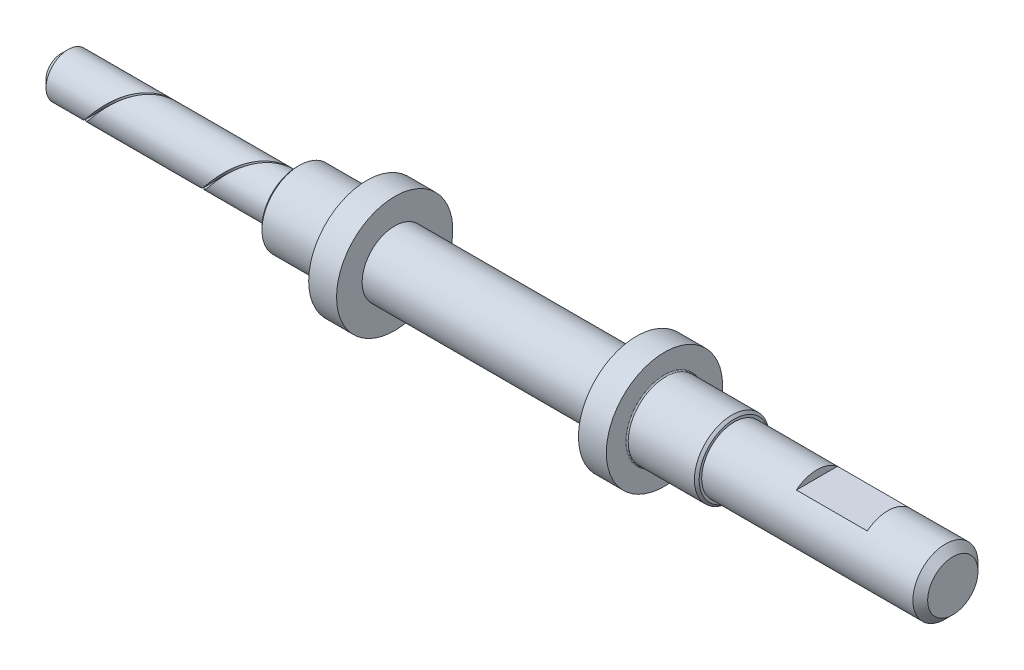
ISO-10303-21;
HEADER;
FILE_DESCRIPTION(('STEP AP214'),'2;1');
FILE_NAME('part.step','',(''),(''),'','','');
FILE_SCHEMA(('AUTOMOTIVE_DESIGN { 1 0 10303 214 1 1 1 1 }'));
ENDSEC;
DATA;
#1=APPLICATION_CONTEXT('core data for automotive mechanical design processes');
#2=APPLICATION_PROTOCOL_DEFINITION('international standard','automotive_design',2000,#1);
#3=PRODUCT_CONTEXT('',#1,'mechanical');
#4=PRODUCT('Part','Part','',(#3));
#5=PRODUCT_RELATED_PRODUCT_CATEGORY('part','',(#4));
#6=PRODUCT_DEFINITION_FORMATION('','',#4);
#7=PRODUCT_DEFINITION_CONTEXT('part definition',#1,'design');
#8=PRODUCT_DEFINITION('design','',#6,#7);
#9=PRODUCT_DEFINITION_SHAPE('','',#8);
#10=(LENGTH_UNIT() NAMED_UNIT(*) SI_UNIT(.MILLI.,.METRE.));
#11=(NAMED_UNIT(*) PLANE_ANGLE_UNIT() SI_UNIT($,.RADIAN.));
#12=(NAMED_UNIT(*) SI_UNIT($,.STERADIAN.) SOLID_ANGLE_UNIT());
#13=UNCERTAINTY_MEASURE_WITH_UNIT(LENGTH_MEASURE(1.E-05),#10,'distance_accuracy_value','');
#14=(GEOMETRIC_REPRESENTATION_CONTEXT(3) GLOBAL_UNCERTAINTY_ASSIGNED_CONTEXT((#13)) GLOBAL_UNIT_ASSIGNED_CONTEXT((#10,
#11,#12)) REPRESENTATION_CONTEXT('',''));
#15=CARTESIAN_POINT('',(0.,0.,0.));
#16=DIRECTION('',(0.,0.,1.));
#17=DIRECTION('',(1.,0.,0.));
#18=AXIS2_PLACEMENT_3D('',#15,#16,#17);
#19=CARTESIAN_POINT('',(0.,0.,0.));
#20=DIRECTION('',(-1.,0.,0.));
#21=DIRECTION('',(0.,0.,1.));
#22=AXIS2_PLACEMENT_3D('',#19,#20,#21);
#23=CYLINDRICAL_SURFACE('',#22,2.38125);
#24=CARTESIAN_POINT('',(-0.361353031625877,0.,0.));
#25=DIRECTION('',(1.,0.,0.));
#26=DIRECTION('',(0.,0.,-1.));
#27=AXIS2_PLACEMENT_3D('',#24,#25,#26);
#28=CIRCLE('',#27,2.38125);
#29=CARTESIAN_POINT('',(-0.361353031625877,0.,-2.38125));
#30=VERTEX_POINT('',#29);
#31=EDGE_CURVE('E844',#30,#30,#28,.T.);
#32=ORIENTED_EDGE('',*,*,#31,.T.);
#33=EDGE_LOOP('',(#32));
#34=FACE_BOUND('',#33,.T.);
#35=CARTESIAN_POINT('',(0.,0.,0.));
#36=DIRECTION('',(-1.,0.,0.));
#37=DIRECTION('',(0.,0.,1.));
#38=AXIS2_PLACEMENT_3D('',#35,#36,#37);
#39=CIRCLE('',#38,2.38125);
#40=CARTESIAN_POINT('',(0.,0.,2.38125));
#41=VERTEX_POINT('',#40);
#42=EDGE_CURVE('E362',#41,#41,#39,.T.);
#43=ORIENTED_EDGE('',*,*,#42,.T.);
#44=EDGE_LOOP('',(#43));
#45=FACE_BOUND('',#44,.T.);
#46=ADVANCED_FACE('F260',(#34,#45),#23,.T.);
#47=CARTESIAN_POINT('',(0.,2.38125,0.));
#48=DIRECTION('',(1.,0.,0.));
#49=DIRECTION('',(0.,0.,-1.));
#50=AXIS2_PLACEMENT_3D('',#47,#48,#49);
#51=PLANE('',#50);
#52=CARTESIAN_POINT('',(0.,0.,0.));
#53=DIRECTION('',(1.,0.,0.));
#54=DIRECTION('',(0.,0.,-1.));
#55=AXIS2_PLACEMENT_3D('',#52,#53,#54);
#56=CIRCLE('',#55,3.77189999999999);
#57=CARTESIAN_POINT('',(0.,0.,-3.77189999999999));
#58=VERTEX_POINT('',#57);
#59=EDGE_CURVE('E386',#58,#58,#56,.F.);
#60=ORIENTED_EDGE('',*,*,#59,.T.);
#61=EDGE_LOOP('',(#60));
#62=FACE_BOUND('',#61,.T.);
#63=ORIENTED_EDGE('',*,*,#42,.F.);
#64=EDGE_LOOP('',(#63));
#65=FACE_BOUND('',#64,.T.);
#66=ADVANCED_FACE('F487',(#62,#65),#51,.F.);
#67=CARTESIAN_POINT('',(0.,0.,0.));
#68=DIRECTION('',(-1.,0.,0.));
#69=DIRECTION('',(0.,0.,1.));
#70=AXIS2_PLACEMENT_3D('',#67,#68,#69);
#71=CYLINDRICAL_SURFACE('',#70,4.0259);
#72=CARTESIAN_POINT('',(7.37301040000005,0.,0.));
#73=DIRECTION('',(1.,0.,0.));
#74=DIRECTION('',(0.,1.,0.));
#75=AXIS2_PLACEMENT_3D('',#72,#73,#74);
#76=CIRCLE('',#75,4.0259);
#77=CARTESIAN_POINT('',(7.37301040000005,4.0259,0.));
#78=VERTEX_POINT('',#77);
#79=EDGE_CURVE('E474',#78,#78,#76,.F.);
#80=ORIENTED_EDGE('',*,*,#79,.T.);
#81=EDGE_LOOP('',(#80));
#82=FACE_BOUND('',#81,.T.);
#83=CARTESIAN_POINT('',(0.253999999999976,0.,0.));
#84=DIRECTION('',(1.,0.,0.));
#85=DIRECTION('',(0.,0.,-1.));
#86=AXIS2_PLACEMENT_3D('',#83,#84,#85);
#87=CIRCLE('',#86,4.0259);
#88=CARTESIAN_POINT('',(0.253999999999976,0.,-4.0259));
#89=VERTEX_POINT('',#88);
#90=EDGE_CURVE('E389',#89,#89,#87,.T.);
#91=ORIENTED_EDGE('',*,*,#90,.T.);
#92=EDGE_LOOP('',(#91));
#93=FACE_BOUND('',#92,.T.);
#94=ADVANCED_FACE('F493',(#82,#93),#71,.T.);
#95=CARTESIAN_POINT('',(7.50001040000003,4.0259,0.));
#96=DIRECTION('',(1.,0.,0.));
#97=DIRECTION('',(0.,0.,-1.));
#98=AXIS2_PLACEMENT_3D('',#95,#96,#97);
#99=PLANE('',#98);
#100=CARTESIAN_POINT('',(7.50001040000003,0.,0.));
#101=DIRECTION('',(1.,0.,0.));
#102=DIRECTION('',(0.,1.,0.));
#103=AXIS2_PLACEMENT_3D('',#100,#101,#102);
#104=CIRCLE('',#103,4.1529);
#105=CARTESIAN_POINT('',(7.50001040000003,4.1529,0.));
#106=VERTEX_POINT('',#105);
#107=EDGE_CURVE('E771',#106,#106,#104,.T.);
#108=ORIENTED_EDGE('',*,*,#107,.T.);
#109=EDGE_LOOP('',(#108));
#110=FACE_BOUND('',#109,.T.);
#111=CARTESIAN_POINT('',(7.50001040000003,0.,0.));
#112=DIRECTION('',(-1.,0.,0.));
#113=DIRECTION('',(0.,0.,1.));
#114=AXIS2_PLACEMENT_3D('',#111,#112,#113);
#115=CIRCLE('',#114,6.2484);
#116=CARTESIAN_POINT('',(7.50001040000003,0.,6.2484));
#117=VERTEX_POINT('',#116);
#118=EDGE_CURVE('E383',#117,#117,#115,.T.);
#119=ORIENTED_EDGE('',*,*,#118,.T.);
#120=EDGE_LOOP('',(#119));
#121=FACE_BOUND('',#120,.T.);
#122=ADVANCED_FACE('F720',(#110,#121),#99,.F.);
#123=CARTESIAN_POINT('',(0.,0.,0.));
#124=DIRECTION('',(-1.,0.,0.));
#125=DIRECTION('',(0.,0.,1.));
#126=AXIS2_PLACEMENT_3D('',#123,#124,#125);
#127=CYLINDRICAL_SURFACE('',#126,6.2484);
#128=ORIENTED_EDGE('',*,*,#118,.F.);
#129=EDGE_LOOP('',(#128));
#130=FACE_BOUND('',#129,.T.);
#131=CARTESIAN_POINT('',(10.4972104,0.,0.));
#132=DIRECTION('',(-1.,0.,0.));
#133=DIRECTION('',(0.,0.,1.));
#134=AXIS2_PLACEMENT_3D('',#131,#132,#133);
#135=CIRCLE('',#134,6.2484);
#136=CARTESIAN_POINT('',(10.4972104,0.,6.2484));
#137=VERTEX_POINT('',#136);
#138=EDGE_CURVE('E380',#137,#137,#135,.T.);
#139=ORIENTED_EDGE('',*,*,#138,.T.);
#140=EDGE_LOOP('',(#139));
#141=FACE_BOUND('',#140,.T.);
#142=ADVANCED_FACE('F710',(#130,#141),#127,.T.);
#143=CARTESIAN_POINT('',(10.4972104,6.2484,0.));
#144=DIRECTION('',(-1.,0.,0.));
#145=DIRECTION('',(0.,0.,1.));
#146=AXIS2_PLACEMENT_3D('',#143,#144,#145);
#147=PLANE('',#146);
#148=ORIENTED_EDGE('',*,*,#138,.F.);
#149=EDGE_LOOP('',(#148));
#150=FACE_BOUND('',#149,.T.);
#151=CARTESIAN_POINT('',(10.4972104,0.,0.));
#152=DIRECTION('',(-1.,0.,0.));
#153=DIRECTION('',(0.,0.,1.));
#154=AXIS2_PLACEMENT_3D('',#151,#152,#153);
#155=CIRCLE('',#154,3.5000057);
#156=CARTESIAN_POINT('',(10.4972104,0.,3.5000057));
#157=VERTEX_POINT('',#156);
#158=EDGE_CURVE('E377',#157,#157,#155,.T.);
#159=ORIENTED_EDGE('',*,*,#158,.T.);
#160=EDGE_LOOP('',(#159));
#161=FACE_BOUND('',#160,.T.);
#162=ADVANCED_FACE('F700',(#150,#161),#147,.F.);
#163=CARTESIAN_POINT('',(0.,0.,0.));
#164=DIRECTION('',(-1.,0.,0.));
#165=DIRECTION('',(0.,0.,1.));
#166=AXIS2_PLACEMENT_3D('',#163,#164,#165);
#167=CYLINDRICAL_SURFACE('',#166,3.5000057);
#168=ORIENTED_EDGE('',*,*,#158,.F.);
#169=EDGE_LOOP('',(#168));
#170=FACE_BOUND('',#169,.T.);
#171=CARTESIAN_POINT('',(36.50275402,0.,0.));
#172=DIRECTION('',(-1.,0.,0.));
#173=DIRECTION('',(0.,0.,1.));
#174=AXIS2_PLACEMENT_3D('',#171,#172,#173);
#175=CIRCLE('',#174,3.5000057);
#176=CARTESIAN_POINT('',(36.50275402,0.,3.5000057));
#177=VERTEX_POINT('',#176);
#178=EDGE_CURVE('E374',#177,#177,#175,.T.);
#179=ORIENTED_EDGE('',*,*,#178,.T.);
#180=EDGE_LOOP('',(#179));
#181=FACE_BOUND('',#180,.T.);
#182=ADVANCED_FACE('F690',(#170,#181),#167,.T.);
#183=CARTESIAN_POINT('',(36.50275402,3.5000057,0.));
#184=DIRECTION('',(1.,0.,0.));
#185=DIRECTION('',(0.,0.,-1.));
#186=AXIS2_PLACEMENT_3D('',#183,#184,#185);
#187=PLANE('',#186);
#188=ORIENTED_EDGE('',*,*,#178,.F.);
#189=EDGE_LOOP('',(#188));
#190=FACE_BOUND('',#189,.T.);
#191=CARTESIAN_POINT('',(36.50275402,0.,0.));
#192=DIRECTION('',(-1.,0.,0.));
#193=DIRECTION('',(0.,0.,1.));
#194=AXIS2_PLACEMENT_3D('',#191,#192,#193);
#195=CIRCLE('',#194,6.2484);
#196=CARTESIAN_POINT('',(36.50275402,0.,6.2484));
#197=VERTEX_POINT('',#196);
#198=EDGE_CURVE('E371',#197,#197,#195,.T.);
#199=ORIENTED_EDGE('',*,*,#198,.T.);
#200=EDGE_LOOP('',(#199));
#201=FACE_BOUND('',#200,.T.);
#202=ADVANCED_FACE('F680',(#190,#201),#187,.F.);
#203=CARTESIAN_POINT('',(0.,0.,0.));
#204=DIRECTION('',(-1.,0.,0.));
#205=DIRECTION('',(0.,0.,1.));
#206=AXIS2_PLACEMENT_3D('',#203,#204,#205);
#207=CYLINDRICAL_SURFACE('',#206,6.2484);
#208=ORIENTED_EDGE('',*,*,#198,.F.);
#209=EDGE_LOOP('',(#208));
#210=FACE_BOUND('',#209,.T.);
#211=CARTESIAN_POINT('',(39.4999540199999,0.,0.));
#212=DIRECTION('',(-1.,0.,0.));
#213=DIRECTION('',(0.,0.,1.));
#214=AXIS2_PLACEMENT_3D('',#211,#212,#213);
#215=CIRCLE('',#214,6.2484);
#216=CARTESIAN_POINT('',(39.4999540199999,0.,6.2484));
#217=VERTEX_POINT('',#216);
#218=EDGE_CURVE('E368',#217,#217,#215,.T.);
#219=ORIENTED_EDGE('',*,*,#218,.T.);
#220=EDGE_LOOP('',(#219));
#221=FACE_BOUND('',#220,.T.);
#222=ADVANCED_FACE('F670',(#210,#221),#207,.T.);
#223=CARTESIAN_POINT('',(39.4999540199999,4.0259,0.));
#224=DIRECTION('',(-1.,0.,0.));
#225=DIRECTION('',(0.,0.,1.));
#226=AXIS2_PLACEMENT_3D('',#223,#224,#225);
#227=PLANE('',#226);
#228=CARTESIAN_POINT('',(39.4999540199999,0.,0.));
#229=DIRECTION('',(-1.,0.,0.));
#230=DIRECTION('',(0.,-1.,0.));
#231=AXIS2_PLACEMENT_3D('',#228,#229,#230);
#232=CIRCLE('',#231,4.1529);
#233=CARTESIAN_POINT('',(39.4999540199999,-4.1529,0.));
#234=VERTEX_POINT('',#233);
#235=EDGE_CURVE('E268',#234,#234,#232,.T.);
#236=ORIENTED_EDGE('',*,*,#235,.T.);
#237=EDGE_LOOP('',(#236));
#238=FACE_BOUND('',#237,.T.);
#239=ORIENTED_EDGE('',*,*,#218,.F.);
#240=EDGE_LOOP('',(#239));
#241=FACE_BOUND('',#240,.T.);
#242=ADVANCED_FACE('F660',(#238,#241),#227,.F.);
#243=CARTESIAN_POINT('',(0.,0.,0.));
#244=DIRECTION('',(-1.,0.,0.));
#245=DIRECTION('',(0.,0.,1.));
#246=AXIS2_PLACEMENT_3D('',#243,#244,#245);
#247=CYLINDRICAL_SURFACE('',#246,4.0259);
#248=CARTESIAN_POINT('',(39.6269540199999,0.,0.));
#249=DIRECTION('',(-1.,0.,0.));
#250=DIRECTION('',(0.,-1.,0.));
#251=AXIS2_PLACEMENT_3D('',#248,#249,#250);
#252=CIRCLE('',#251,4.0259);
#253=CARTESIAN_POINT('',(39.6269540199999,-4.0259,0.));
#254=VERTEX_POINT('',#253);
#255=EDGE_CURVE('E12',#254,#254,#252,.F.);
#256=ORIENTED_EDGE('',*,*,#255,.T.);
#257=EDGE_LOOP('',(#256));
#258=FACE_BOUND('',#257,.T.);
#259=CARTESIAN_POINT('',(46.74596442,0.,0.));
#260=DIRECTION('',(-1.,0.,0.));
#261=DIRECTION('',(0.,0.,1.));
#262=AXIS2_PLACEMENT_3D('',#259,#260,#261);
#263=CIRCLE('',#262,4.0259);
#264=CARTESIAN_POINT('',(46.74596442,0.,4.0259));
#265=VERTEX_POINT('',#264);
#266=EDGE_CURVE('E392',#265,#265,#263,.T.);
#267=ORIENTED_EDGE('',*,*,#266,.T.);
#268=EDGE_LOOP('',(#267));
#269=FACE_BOUND('',#268,.T.);
#270=ADVANCED_FACE('F650',(#258,#269),#247,.T.);
#271=CARTESIAN_POINT('',(46.99996442,4.0259,0.));
#272=DIRECTION('',(-1.,0.,0.));
#273=DIRECTION('',(0.,0.,1.));
#274=AXIS2_PLACEMENT_3D('',#271,#272,#273);
#275=PLANE('',#274);
#276=CARTESIAN_POINT('',(46.99996442,0.,0.));
#277=DIRECTION('',(-1.,0.,0.));
#278=DIRECTION('',(0.,0.,1.));
#279=AXIS2_PLACEMENT_3D('',#276,#277,#278);
#280=CIRCLE('',#279,3.77190000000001);
#281=CARTESIAN_POINT('',(46.99996442,0.,3.77190000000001));
#282=VERTEX_POINT('',#281);
#283=EDGE_CURVE('E395',#282,#282,#280,.F.);
#284=ORIENTED_EDGE('',*,*,#283,.T.);
#285=EDGE_LOOP('',(#284));
#286=FACE_BOUND('',#285,.T.);
#287=CARTESIAN_POINT('',(46.99996442,0.,0.));
#288=DIRECTION('',(-1.,0.,0.));
#289=DIRECTION('',(0.,0.,1.));
#290=AXIS2_PLACEMENT_3D('',#287,#288,#289);
#291=CIRCLE('',#290,3.5000057);
#292=CARTESIAN_POINT('',(46.99996442,0.,3.5000057));
#293=VERTEX_POINT('',#292);
#294=EDGE_CURVE('E365',#293,#293,#291,.T.);
#295=ORIENTED_EDGE('',*,*,#294,.T.);
#296=EDGE_LOOP('',(#295));
#297=FACE_BOUND('',#296,.T.);
#298=ADVANCED_FACE('F640',(#286,#297),#275,.F.);
#299=CARTESIAN_POINT('',(0.,0.,0.));
#300=DIRECTION('',(-1.,0.,0.));
#301=DIRECTION('',(0.,0.,1.));
#302=AXIS2_PLACEMENT_3D('',#299,#300,#301);
#303=CYLINDRICAL_SURFACE('',#302,3.5000057);
#304=CARTESIAN_POINT('',(63.50996442,0.,0.));
#305=DIRECTION('',(1.,0.,0.));
#306=DIRECTION('',(0.,0.,-1.));
#307=AXIS2_PLACEMENT_3D('',#304,#305,#306);
#308=CIRCLE('',#307,3.5000057);
#309=CARTESIAN_POINT('',(63.50996442,-2.2092648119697,-2.71462499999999));
#310=VERTEX_POINT('',#309);
#311=CARTESIAN_POINT('',(63.50996442,2.20926481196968,-2.71462500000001));
#312=VERTEX_POINT('',#311);
#313=EDGE_CURVE('E426',#310,#312,#308,.T.);
#314=ORIENTED_EDGE('',*,*,#313,.T.);
#315=DIRECTION('',(-1.,0.,0.));
#316=VECTOR('',#315,1.);
#317=CARTESIAN_POINT('',(0.,2.20926481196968,-2.71462500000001));
#318=LINE('',#317,#316);
#319=CARTESIAN_POINT('',(55.8899644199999,2.20926481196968,-2.71462500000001));
#320=VERTEX_POINT('',#319);
#321=EDGE_CURVE('E429',#312,#320,#318,.T.);
#322=ORIENTED_EDGE('',*,*,#321,.T.);
#323=CARTESIAN_POINT('',(55.8899644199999,0.,0.));
#324=DIRECTION('',(-1.,0.,0.));
#325=DIRECTION('',(0.,0.,1.));
#326=AXIS2_PLACEMENT_3D('',#323,#324,#325);
#327=CIRCLE('',#326,3.5000057);
#328=CARTESIAN_POINT('',(55.8899644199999,-2.2092648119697,-2.71462499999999));
#329=VERTEX_POINT('',#328);
#330=EDGE_CURVE('E423',#320,#329,#327,.T.);
#331=ORIENTED_EDGE('',*,*,#330,.T.);
#332=DIRECTION('',(-1.,0.,0.));
#333=VECTOR('',#332,1.);
#334=CARTESIAN_POINT('',(0.,-2.2092648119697,-2.71462499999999));
#335=LINE('',#334,#333);
#336=EDGE_CURVE('E420',#329,#310,#335,.F.);
#337=ORIENTED_EDGE('',*,*,#336,.T.);
#338=EDGE_LOOP('',(#314,#322,#331,#337));
#339=FACE_BOUND('',#338,.T.);
#340=CARTESIAN_POINT('',(63.50996442,0.,0.));
#341=DIRECTION('',(1.,0.,0.));
#342=DIRECTION('',(0.,0.,-1.));
#343=AXIS2_PLACEMENT_3D('',#340,#341,#342);
#344=CIRCLE('',#343,3.5000057);
#345=CARTESIAN_POINT('',(63.50996442,2.714625,-2.20926481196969));
#346=VERTEX_POINT('',#345);
#347=CARTESIAN_POINT('',(63.50996442,2.714625,2.20926481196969));
#348=VERTEX_POINT('',#347);
#349=EDGE_CURVE('E414',#346,#348,#344,.T.);
#350=ORIENTED_EDGE('',*,*,#349,.T.);
#351=DIRECTION('',(-1.,0.,0.));
#352=VECTOR('',#351,1.);
#353=CARTESIAN_POINT('',(0.,2.714625,2.20926481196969));
#354=LINE('',#353,#352);
#355=CARTESIAN_POINT('',(55.8899644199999,2.714625,2.20926481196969));
#356=VERTEX_POINT('',#355);
#357=EDGE_CURVE('E417',#348,#356,#354,.T.);
#358=ORIENTED_EDGE('',*,*,#357,.T.);
#359=CARTESIAN_POINT('',(55.8899644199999,0.,0.));
#360=DIRECTION('',(-1.,0.,0.));
#361=DIRECTION('',(0.,0.,1.));
#362=AXIS2_PLACEMENT_3D('',#359,#360,#361);
#363=CIRCLE('',#362,3.5000057);
#364=CARTESIAN_POINT('',(55.8899644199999,2.714625,-2.20926481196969));
#365=VERTEX_POINT('',#364);
#366=EDGE_CURVE('E411',#356,#365,#363,.T.);
#367=ORIENTED_EDGE('',*,*,#366,.T.);
#368=DIRECTION('',(-1.,0.,0.));
#369=VECTOR('',#368,1.);
#370=CARTESIAN_POINT('',(0.,2.714625,-2.20926481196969));
#371=LINE('',#370,#369);
#372=EDGE_CURVE('E408',#365,#346,#371,.F.);
#373=ORIENTED_EDGE('',*,*,#372,.T.);
#374=EDGE_LOOP('',(#350,#358,#367,#373));
#375=FACE_BOUND('',#374,.T.);
#376=CARTESIAN_POINT('',(69.7062182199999,0.,0.));
#377=DIRECTION('',(-1.,0.,0.));
#378=DIRECTION('',(0.,0.,1.));
#379=AXIS2_PLACEMENT_3D('',#376,#377,#378);
#380=CIRCLE('',#379,3.5000057);
#381=CARTESIAN_POINT('',(69.7062182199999,0.,3.50000569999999));
#382=VERTEX_POINT('',#381);
#383=EDGE_CURVE('E398',#382,#382,#380,.T.);
#384=ORIENTED_EDGE('',*,*,#383,.T.);
#385=EDGE_LOOP('',(#384));
#386=FACE_BOUND('',#385,.T.);
#387=ORIENTED_EDGE('',*,*,#294,.F.);
#388=EDGE_LOOP('',(#387));
#389=FACE_BOUND('',#388,.T.);
#390=ADVANCED_FACE('F630',(#339,#375,#386,#389),#303,.T.);
#391=CARTESIAN_POINT('',(70.49996822,3.5000057,0.));
#392=DIRECTION('',(-1.,0.,0.));
#393=DIRECTION('',(0.,0.,1.));
#394=AXIS2_PLACEMENT_3D('',#391,#392,#393);
#395=PLANE('',#394);
#396=CARTESIAN_POINT('',(70.49996822,0.,0.));
#397=DIRECTION('',(-1.,0.,0.));
#398=DIRECTION('',(0.,0.,1.));
#399=AXIS2_PLACEMENT_3D('',#396,#397,#398);
#400=CIRCLE('',#399,2.70625569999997);
#401=CARTESIAN_POINT('',(70.4999682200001,0.,2.70625569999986));
#402=VERTEX_POINT('',#401);
#403=EDGE_CURVE('E401',#402,#402,#400,.F.);
#404=ORIENTED_EDGE('',*,*,#403,.T.);
#405=EDGE_LOOP('',(#404));
#406=FACE_BOUND('',#405,.T.);
#407=ADVANCED_FACE('F619',(#406),#395,.F.);
#408=CARTESIAN_POINT('',(0.,0.,0.));
#409=DIRECTION('',(1.,0.,0.));
#410=DIRECTION('',(0.,0.,-1.));
#411=AXIS2_PLACEMENT_3D('',#408,#409,#410);
#412=CONICAL_SURFACE('',#411,3.77189999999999,0.785398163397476);
#413=ORIENTED_EDGE('',*,*,#90,.F.);
#414=EDGE_LOOP('',(#413));
#415=FACE_BOUND('',#414,.T.);
#416=ORIENTED_EDGE('',*,*,#59,.F.);
#417=EDGE_LOOP('',(#416));
#418=FACE_BOUND('',#417,.T.);
#419=ADVANCED_FACE('F609',(#415,#418),#412,.T.);
#420=CARTESIAN_POINT('',(46.74596442,0.,0.));
#421=DIRECTION('',(-1.,0.,0.));
#422=DIRECTION('',(0.,0.,1.));
#423=AXIS2_PLACEMENT_3D('',#420,#421,#422);
#424=CONICAL_SURFACE('',#423,4.0259,0.78539816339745);
#425=ORIENTED_EDGE('',*,*,#283,.F.);
#426=EDGE_LOOP('',(#425));
#427=FACE_BOUND('',#426,.T.);
#428=ORIENTED_EDGE('',*,*,#266,.F.);
#429=EDGE_LOOP('',(#428));
#430=FACE_BOUND('',#429,.T.);
#431=ADVANCED_FACE('F600',(#427,#430),#424,.T.);
#432=CARTESIAN_POINT('',(69.7062182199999,0.,0.));
#433=DIRECTION('',(-1.,0.,0.));
#434=DIRECTION('',(0.,0.,1.));
#435=AXIS2_PLACEMENT_3D('',#432,#433,#434);
#436=CONICAL_SURFACE('',#435,3.5000057,0.785398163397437);
#437=CARTESIAN_POINT('',(70.4999682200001,0.,2.70625569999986));
#438=CARTESIAN_POINT('',(70.4916999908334,0.,2.71452392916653));
#439=CARTESIAN_POINT('',(70.4834317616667,0.,2.7227921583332));
#440=CARTESIAN_POINT('',(70.4668953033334,0.,2.73932861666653));
#441=CARTESIAN_POINT('',(70.4586270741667,0.,2.7475968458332));
#442=CARTESIAN_POINT('',(70.4420906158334,0.,2.76413330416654));
#443=CARTESIAN_POINT('',(70.4338223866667,0.,2.77240153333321));
#444=CARTESIAN_POINT('',(70.4172859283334,0.,2.78893799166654));
#445=CARTESIAN_POINT('',(70.4090176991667,0.,2.79720622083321));
#446=CARTESIAN_POINT('',(70.3924812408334,0.,2.81374267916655));
#447=CARTESIAN_POINT('',(70.3842130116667,0.,2.82201090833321));
#448=CARTESIAN_POINT('',(70.3676765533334,0.,2.83854736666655));
#449=CARTESIAN_POINT('',(70.3594083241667,0.,2.84681559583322));
#450=CARTESIAN_POINT('',(70.3428718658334,0.,2.86335205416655));
#451=CARTESIAN_POINT('',(70.3346036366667,0.,2.87162028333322));
#452=CARTESIAN_POINT('',(70.3180671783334,0.,2.88815674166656));
#453=CARTESIAN_POINT('',(70.3097989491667,0.,2.89642497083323));
#454=CARTESIAN_POINT('',(70.2932624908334,0.,2.91296142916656));
#455=CARTESIAN_POINT('',(70.2849942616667,0.,2.92122965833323));
#456=CARTESIAN_POINT('',(70.2684578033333,0.,2.93776611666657));
#457=CARTESIAN_POINT('',(70.2601895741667,0.,2.94603434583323));
#458=CARTESIAN_POINT('',(70.2436531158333,0.,2.96257080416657));
#459=CARTESIAN_POINT('',(70.2353848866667,0.,2.97083903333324));
#460=CARTESIAN_POINT('',(70.2188484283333,0.,2.98737549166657));
#461=CARTESIAN_POINT('',(70.2105801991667,0.,2.99564372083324));
#462=CARTESIAN_POINT('',(70.1940437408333,0.,3.01218017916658));
#463=CARTESIAN_POINT('',(70.1857755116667,0.,3.02044840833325));
#464=CARTESIAN_POINT('',(70.1692390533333,0.,3.03698486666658));
#465=CARTESIAN_POINT('',(70.1609708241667,0.,3.04525309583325));
#466=CARTESIAN_POINT('',(70.1444343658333,0.,3.06178955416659));
#467=CARTESIAN_POINT('',(70.1361661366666,0.,3.07005778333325));
#468=CARTESIAN_POINT('',(70.1196296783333,0.,3.08659424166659));
#469=CARTESIAN_POINT('',(70.1113614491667,0.,3.09486247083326));
#470=CARTESIAN_POINT('',(70.0948249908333,0.,3.11139892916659));
#471=CARTESIAN_POINT('',(70.0865567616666,0.,3.11966715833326));
#472=CARTESIAN_POINT('',(70.0700203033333,0.,3.1362036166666));
#473=CARTESIAN_POINT('',(70.0617520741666,0.,3.14447184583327));
#474=CARTESIAN_POINT('',(70.0452156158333,0.,3.1610083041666));
#475=CARTESIAN_POINT('',(70.0369473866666,0.,3.16927653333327));
#476=CARTESIAN_POINT('',(70.0204109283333,0.,3.18581299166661));
#477=CARTESIAN_POINT('',(70.0121426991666,0.,3.19408122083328));
#478=CARTESIAN_POINT('',(69.9956062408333,0.,3.21061767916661));
#479=CARTESIAN_POINT('',(69.9873380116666,0.,3.21888590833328));
#480=CARTESIAN_POINT('',(69.9708015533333,0.,3.23542236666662));
#481=CARTESIAN_POINT('',(69.9625333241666,0.,3.24369059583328));
#482=CARTESIAN_POINT('',(69.9459968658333,0.,3.26022705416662));
#483=CARTESIAN_POINT('',(69.9377286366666,0.,3.26849528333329));
#484=CARTESIAN_POINT('',(69.9211921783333,0.,3.28503174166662));
#485=CARTESIAN_POINT('',(69.9129239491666,0.,3.29329997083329));
#486=CARTESIAN_POINT('',(69.8963874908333,0.,3.30983642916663));
#487=CARTESIAN_POINT('',(69.8881192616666,0.,3.3181046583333));
#488=CARTESIAN_POINT('',(69.8715828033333,0.,3.33464111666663));
#489=CARTESIAN_POINT('',(69.8633145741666,0.,3.3429093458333));
#490=CARTESIAN_POINT('',(69.8467781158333,0.,3.35944580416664));
#491=CARTESIAN_POINT('',(69.8385098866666,0.,3.3677140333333));
#492=CARTESIAN_POINT('',(69.8219734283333,0.,3.38425049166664));
#493=CARTESIAN_POINT('',(69.8137051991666,0.,3.39251872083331));
#494=CARTESIAN_POINT('',(69.7971687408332,0.,3.40905517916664));
#495=CARTESIAN_POINT('',(69.7889005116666,0.,3.41732340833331));
#496=CARTESIAN_POINT('',(69.7723640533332,0.,3.43385986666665));
#497=CARTESIAN_POINT('',(69.7640958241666,0.,3.44212809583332));
#498=CARTESIAN_POINT('',(69.7475593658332,0.,3.45866455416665));
#499=CARTESIAN_POINT('',(69.7392911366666,0.,3.46693278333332));
#500=CARTESIAN_POINT('',(69.7227546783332,0.,3.48346924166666));
#501=CARTESIAN_POINT('',(69.7144864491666,0.,3.49173747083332));
#502=CARTESIAN_POINT('',(69.7062182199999,0.,3.50000569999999));
#503=B_SPLINE_CURVE_WITH_KNOTS('',3,(#437,#438,#439,#440,#441,#442,#443,#444,#445,#446,#447,
#448,#449,#450,#451,#452,#453,#454,#455,#456,#457,#458,#459,#460,#461,#462,#463,#464,#465,#466,
#467,#468,#469,#470,#471,#472,#473,#474,#475,#476,#477,#478,#479,#480,#481,#482,#483,#484,#485,
#486,#487,#488,#489,#490,#491,#492,#493,#494,#495,#496,#497,#498,#499,#500,#501,#502),
.UNSPECIFIED.,.F.,.F.,(4,2,2,2,2,2,2,2,2,2,2,2,2,2,2,2,2,2,2,2,2,2,2,2,2,2,2,2,2,2,2,2,4),(0.,
0.0350791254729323,0.070158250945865,0.105237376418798,0.14031650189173,0.175395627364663,
0.210474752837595,0.245553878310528,0.280633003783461,0.315712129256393,0.350791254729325,
0.385870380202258,0.420949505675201,0.456028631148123,0.491107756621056,0.526186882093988,
0.561266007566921,0.596345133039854,0.631424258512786,0.666503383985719,0.701582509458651,
0.736661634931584,0.771740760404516,0.806819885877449,0.841899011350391,0.876978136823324,
0.912057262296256,0.947136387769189,0.982215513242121,1.01729463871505,1.05237376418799,
1.08745288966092,1.12253201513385),.UNSPECIFIED.);
#504=EDGE_CURVE('BSEAM591',#402,#382,#503,.T.);
#505=ORIENTED_EDGE('',*,*,#403,.F.);
#506=ORIENTED_EDGE('',*,*,#383,.F.);
#507=ORIENTED_EDGE('',*,*,#504,.T.);
#508=ORIENTED_EDGE('',*,*,#504,.F.);
#509=EDGE_LOOP('',(#505,#507,#506,#508));
#510=FACE_BOUND('',#509,.T.);
#511=ADVANCED_FACE('F591',(#510),#436,.T.);
#512=CARTESIAN_POINT('',(63.50996442,2.714625,-5.529541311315));
#513=DIRECTION('',(1.,0.,0.));
#514=DIRECTION('',(0.,0.,-1.));
#515=AXIS2_PLACEMENT_3D('',#512,#513,#514);
#516=PLANE('',#515);
#517=DIRECTION('',(0.,0.,-1.));
#518=VECTOR('',#517,1.);
#519=CARTESIAN_POINT('',(63.50996442,2.714625,-5.529541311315));
#520=LINE('',#519,#518);
#521=EDGE_CURVE('E357',#348,#346,#520,.T.);
#522=ORIENTED_EDGE('',*,*,#521,.F.);
#523=ORIENTED_EDGE('',*,*,#349,.F.);
#524=EDGE_LOOP('',(#522,#523));
#525=FACE_BOUND('',#524,.T.);
#526=ADVANCED_FACE('F581',(#525),#516,.F.);
#527=CARTESIAN_POINT('',(55.8899644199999,2.714625,5.529541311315));
#528=DIRECTION('',(-1.,0.,0.));
#529=DIRECTION('',(0.,0.,1.));
#530=AXIS2_PLACEMENT_3D('',#527,#528,#529);
#531=PLANE('',#530);
#532=DIRECTION('',(0.,0.,1.));
#533=VECTOR('',#532,1.);
#534=CARTESIAN_POINT('',(55.8899644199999,2.714625,5.529541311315));
#535=LINE('',#534,#533);
#536=EDGE_CURVE('E359',#365,#356,#535,.T.);
#537=ORIENTED_EDGE('',*,*,#536,.F.);
#538=ORIENTED_EDGE('',*,*,#366,.F.);
#539=EDGE_LOOP('',(#537,#538));
#540=FACE_BOUND('',#539,.T.);
#541=ADVANCED_FACE('F571',(#540),#531,.F.);
#542=CARTESIAN_POINT('',(63.50996442,2.714625,5.529541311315));
#543=DIRECTION('',(0.,-1.,0.));
#544=DIRECTION('',(0.,0.,-1.));
#545=AXIS2_PLACEMENT_3D('',#542,#543,#544);
#546=PLANE('',#545);
#547=ORIENTED_EDGE('',*,*,#521,.T.);
#548=ORIENTED_EDGE('',*,*,#372,.F.);
#549=ORIENTED_EDGE('',*,*,#536,.T.);
#550=ORIENTED_EDGE('',*,*,#357,.F.);
#551=EDGE_LOOP('',(#547,#548,#549,#550));
#552=FACE_BOUND('',#551,.T.);
#553=ADVANCED_FACE('F560',(#552),#546,.F.);
#554=CARTESIAN_POINT('',(63.50996442,-5.52954131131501,-2.71462499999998));
#555=DIRECTION('',(1.,0.,0.));
#556=DIRECTION('',(0.,0.,-1.));
#557=AXIS2_PLACEMENT_3D('',#554,#555,#556);
#558=PLANE('',#557);
#559=DIRECTION('',(0.,-1.,0.));
#560=VECTOR('',#559,1.);
#561=CARTESIAN_POINT('',(63.50996442,-5.52954131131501,-2.71462499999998));
#562=LINE('',#561,#560);
#563=EDGE_CURVE('E283',#312,#310,#562,.T.);
#564=ORIENTED_EDGE('',*,*,#563,.F.);
#565=ORIENTED_EDGE('',*,*,#313,.F.);
#566=EDGE_LOOP('',(#564,#565));
#567=FACE_BOUND('',#566,.T.);
#568=ADVANCED_FACE('F550',(#567),#558,.F.);
#569=CARTESIAN_POINT('',(55.8899644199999,5.52954131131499,-2.71462500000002));
#570=DIRECTION('',(-1.,0.,0.));
#571=DIRECTION('',(0.,0.,1.));
#572=AXIS2_PLACEMENT_3D('',#569,#570,#571);
#573=PLANE('',#572);
#574=DIRECTION('',(0.,1.,0.));
#575=VECTOR('',#574,1.);
#576=CARTESIAN_POINT('',(55.8899644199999,5.52954131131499,-2.71462500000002));
#577=LINE('',#576,#575);
#578=EDGE_CURVE('E354',#329,#320,#577,.T.);
#579=ORIENTED_EDGE('',*,*,#578,.F.);
#580=ORIENTED_EDGE('',*,*,#330,.F.);
#581=EDGE_LOOP('',(#579,#580));
#582=FACE_BOUND('',#581,.T.);
#583=ADVANCED_FACE('F485',(#582),#573,.F.);
#584=CARTESIAN_POINT('',(63.50996442,5.52954131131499,-2.71462500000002));
#585=DIRECTION('',(0.,0.,1.));
#586=DIRECTION('',(0.,-1.,0.));
#587=AXIS2_PLACEMENT_3D('',#584,#585,#586);
#588=PLANE('',#587);
#589=ORIENTED_EDGE('',*,*,#563,.T.);
#590=ORIENTED_EDGE('',*,*,#336,.F.);
#591=ORIENTED_EDGE('',*,*,#578,.T.);
#592=ORIENTED_EDGE('',*,*,#321,.F.);
#593=EDGE_LOOP('',(#589,#590,#591,#592));
#594=FACE_BOUND('',#593,.T.);
#595=ADVANCED_FACE('F478',(#594),#588,.F.);
#596=CARTESIAN_POINT('',(-0.65464696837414,0.,0.));
#597=DIRECTION('',(-1.,0.,0.));
#598=DIRECTION('',(0.,0.,1.));
#599=AXIS2_PLACEMENT_3D('',#596,#597,#598);
#600=CONICAL_SURFACE('',#599,2.38125,1.0471975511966);
#601=CARTESIAN_POINT('',(-0.507999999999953,0.,0.));
#602=DIRECTION('',(1.,0.,0.));
#603=DIRECTION('',(0.,0.,-1.));
#604=AXIS2_PLACEMENT_3D('',#601,#602,#603);
#605=CIRCLE('',#604,2.12725);
#606=CARTESIAN_POINT('',(-0.507999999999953,0.,-2.12725));
#607=VERTEX_POINT('',#606);
#608=EDGE_CURVE('E329',#607,#607,#605,.T.);
#609=ORIENTED_EDGE('',*,*,#608,.F.);
#610=CARTESIAN_POINT('',(-0.65464696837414,0.344659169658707,-2.35617520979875));
#611=CARTESIAN_POINT('',(-0.638594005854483,0.303382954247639,-2.33411537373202));
#612=CARTESIAN_POINT('',(-0.622384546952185,0.262854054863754,-2.31076484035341));
#613=CARTESIAN_POINT('',(-0.59000472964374,0.184312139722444,-2.26207987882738));
#614=CARTESIAN_POINT('',(-0.573840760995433,0.146264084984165,-2.23679769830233));
#615=CARTESIAN_POINT('',(-0.541165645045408,0.0718115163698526,-2.18381069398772));
#616=CARTESIAN_POINT('',(-0.524653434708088,0.035413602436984,-2.15609725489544));
#617=CARTESIAN_POINT('',(-0.507999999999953,0.,-2.12725000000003));
#618=B_SPLINE_CURVE_WITH_KNOTS('',3,(#610,#611,#612,#613,#614,#615,#616,#617),.UNSPECIFIED.,.F.,
.F.,(4,2,2,4),(0.,0.148415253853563,0.293699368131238,0.43952087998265),.UNSPECIFIED.);
#619=CARTESIAN_POINT('',(-0.65464696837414,0.344659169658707,-2.35617520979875));
#620=VERTEX_POINT('',#619);
#621=EDGE_CURVE('E325',#620,#607,#618,.T.);
#622=ORIENTED_EDGE('',*,*,#621,.F.);
#623=CARTESIAN_POINT('',(-0.65464696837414,0.,0.));
#624=DIRECTION('',(1.,0.,0.));
#625=DIRECTION('',(0.,0.,-1.));
#626=AXIS2_PLACEMENT_3D('',#623,#624,#625);
#627=CIRCLE('',#626,2.38125);
#628=CARTESIAN_POINT('',(-0.65464696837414,0.,-2.38125));
#629=VERTEX_POINT('',#628);
#630=EDGE_CURVE('E321',#620,#629,#627,.T.);
#631=ORIENTED_EDGE('',*,*,#630,.T.);
#632=DIRECTION('',(0.499999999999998,0.,0.86602540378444));
#633=VECTOR('',#632,1.);
#634=CARTESIAN_POINT('',(-0.581323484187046,0.,-2.25425));
#635=LINE('',#634,#633);
#636=EDGE_CURVE('E324',#629,#607,#635,.T.);
#637=ORIENTED_EDGE('',*,*,#636,.T.);
#638=EDGE_LOOP('',(#609,#622,#631,#637));
#639=FACE_BOUND('',#638,.T.);
#640=ADVANCED_FACE('F323',(#639),#600,.T.);
#641=CARTESIAN_POINT('',(-0.507999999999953,0.,0.));
#642=DIRECTION('',(1.,0.,0.));
#643=DIRECTION('',(0.,0.,-1.));
#644=AXIS2_PLACEMENT_3D('',#641,#642,#643);
#645=CONICAL_SURFACE('',#644,2.12725,1.0471975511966);
#646=ORIENTED_EDGE('',*,*,#31,.F.);
#647=EDGE_LOOP('',(#646));
#648=FACE_BOUND('',#647,.T.);
#649=ORIENTED_EDGE('',*,*,#608,.T.);
#650=EDGE_LOOP('',(#649));
#651=FACE_BOUND('',#650,.T.);
#652=ADVANCED_FACE('F456',(#648,#651),#645,.T.);
#653=CARTESIAN_POINT('',(-25.4000000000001,2.38125,0.));
#654=DIRECTION('',(1.,0.,0.));
#655=DIRECTION('',(0.,0.,-1.));
#656=AXIS2_PLACEMENT_3D('',#653,#654,#655);
#657=PLANE('',#656);
#658=CARTESIAN_POINT('',(-25.4000000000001,0.,0.));
#659=DIRECTION('',(1.,0.,0.));
#660=DIRECTION('',(0.,0.,-1.));
#661=AXIS2_PLACEMENT_3D('',#658,#659,#660);
#662=CIRCLE('',#661,1.58750000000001);
#663=CARTESIAN_POINT('',(-25.4000000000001,0.,-1.58750000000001));
#664=VERTEX_POINT('',#663);
#665=EDGE_CURVE('E404',#664,#664,#662,.F.);
#666=ORIENTED_EDGE('',*,*,#665,.T.);
#667=EDGE_LOOP('',(#666));
#668=FACE_BOUND('',#667,.T.);
#669=ADVANCED_FACE('F483',(#668),#657,.F.);
#670=CARTESIAN_POINT('',(-25.4000000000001,0.,0.));
#671=DIRECTION('',(1.,0.,0.));
#672=DIRECTION('',(0.,0.,-1.));
#673=AXIS2_PLACEMENT_3D('',#670,#671,#672);
#674=CONICAL_SURFACE('',#673,1.58750000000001,0.785398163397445);
#675=CARTESIAN_POINT('',(-24.6062499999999,-1.56431279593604,-1.79534872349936));
#676=CARTESIAN_POINT('',(-24.6167830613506,-1.5425024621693,-1.80038252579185));
#677=CARTESIAN_POINT('',(-24.6273584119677,-1.52063594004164,-1.80508208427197));
#678=CARTESIAN_POINT('',(-24.6486119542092,-1.4768147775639,-1.81378081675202));
#679=CARTESIAN_POINT('',(-24.6592901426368,-1.45486013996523,-1.81778001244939));
#680=CARTESIAN_POINT('',(-24.6915068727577,-1.38889935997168,-1.82867949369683));
#681=CARTESIAN_POINT('',(-24.713228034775,-1.34479540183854,-1.83448189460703));
#682=CARTESIAN_POINT('',(-24.75563273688,-1.25951336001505,-1.84286408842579));
#683=CARTESIAN_POINT('',(-24.7762870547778,-1.21833919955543,-1.84563534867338));
#684=CARTESIAN_POINT('',(-24.8179827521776,-1.13607271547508,-1.84862256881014));
#685=CARTESIAN_POINT('',(-24.839024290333,-1.09498043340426,-1.84883745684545));
#686=CARTESIAN_POINT('',(-24.8602499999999,-1.0540134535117,-1.8477684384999));
#687=B_SPLINE_CURVE_WITH_KNOTS('',3,(#675,#676,#677,#678,#679,#680,#681,#682,#683,#684,#685,
#686),.UNSPECIFIED.,.F.,.F.,(4,2,2,2,2,4),(0.,0.0742106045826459,0.14841890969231,
0.296832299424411,0.435204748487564,0.573635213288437),.UNSPECIFIED.);
#688=CARTESIAN_POINT('',(-24.6062499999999,-1.56431279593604,-1.79534872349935));
#689=VERTEX_POINT('',#688);
#690=CARTESIAN_POINT('',(-24.8602499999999,-1.05401345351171,-1.84776843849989));
#691=VERTEX_POINT('',#690);
#692=EDGE_CURVE('E440',#689,#691,#687,.T.);
#693=ORIENTED_EDGE('',*,*,#692,.F.);
#694=CARTESIAN_POINT('',(-24.6062499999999,0.,0.));
#695=DIRECTION('',(1.,0.,0.));
#696=DIRECTION('',(0.,0.,-1.));
#697=AXIS2_PLACEMENT_3D('',#694,#695,#696);
#698=CIRCLE('',#697,2.38125);
#699=CARTESIAN_POINT('',(-24.6062499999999,-1.28750349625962,-2.00316906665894));
#700=VERTEX_POINT('',#699);
#701=EDGE_CURVE('E339',#700,#689,#698,.T.);
#702=ORIENTED_EDGE('',*,*,#701,.F.);
#703=CARTESIAN_POINT('',(-24.8602499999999,-1.05401345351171,-1.84776843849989));
#704=CARTESIAN_POINT('',(-24.82687518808,-1.08337988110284,-1.869440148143));
#705=CARTESIAN_POINT('',(-24.7935707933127,-1.1132113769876,-1.89058803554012));
#706=CARTESIAN_POINT('',(-24.7345747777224,-1.16696179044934,-1.92717789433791));
#707=CARTESIAN_POINT('',(-24.708854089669,-1.19070308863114,-1.94283423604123));
#708=CARTESIAN_POINT('',(-24.6574901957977,-1.23871411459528,-1.97349562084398));
#709=CARTESIAN_POINT('',(-24.6318470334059,-1.26298409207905,-1.98850034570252));
#710=CARTESIAN_POINT('',(-24.6062499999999,-1.28750349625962,-2.00316906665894));
#711=B_SPLINE_CURVE_WITH_KNOTS('',3,(#703,#704,#705,#706,#707,#708,#709,#710),.UNSPECIFIED.,.F.,
.F.,(4,2,2,4),(0.,0.14836188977,0.263387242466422,0.378468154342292),.UNSPECIFIED.);
#712=EDGE_CURVE('E432',#691,#700,#711,.T.);
#713=ORIENTED_EDGE('',*,*,#712,.F.);
#714=EDGE_LOOP('',(#693,#702,#713));
#715=FACE_BOUND('',#714,.T.);
#716=ORIENTED_EDGE('',*,*,#665,.F.);
#717=EDGE_LOOP('',(#716));
#718=FACE_BOUND('',#717,.T.);
#719=ADVANCED_FACE('F447',(#715,#718),#674,.T.);
#720=CARTESIAN_POINT('',(-0.507999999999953,0.,-2.12725));
#721=CARTESIAN_POINT('',(-0.860777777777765,0.375091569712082,-2.12725));
#722=CARTESIAN_POINT('',(-1.21355555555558,0.727562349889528,-1.99896112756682));
#723=CARTESIAN_POINT('',(-1.56633333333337,1.08003313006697,-1.87067225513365));
#724=CARTESIAN_POINT('',(-1.91911111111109,1.36736994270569,-1.62956804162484));
#725=CARTESIAN_POINT('',(-2.27188888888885,1.6547067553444,-1.38846382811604));
#726=CARTESIAN_POINT('',(-2.62466666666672,1.84225254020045,-1.063625));
#727=CARTESIAN_POINT('',(-2.97744444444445,2.02979832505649,-0.738786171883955));
#728=CARTESIAN_POINT('',(-3.33022222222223,2.09493229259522,-0.369393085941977));
#729=CARTESIAN_POINT('',(-3.68300000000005,2.16006626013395,0.));
#730=CARTESIAN_POINT('',(-4.03577777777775,2.09493229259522,0.369393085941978));
#731=CARTESIAN_POINT('',(-4.38855555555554,2.02979832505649,0.738786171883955));
#732=CARTESIAN_POINT('',(-4.74133333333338,1.84225254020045,1.063625));
#733=CARTESIAN_POINT('',(-5.09411111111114,1.65470675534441,1.38846382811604));
#734=CARTESIAN_POINT('',(-5.44688888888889,1.36736994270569,1.62956804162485));
#735=CARTESIAN_POINT('',(-5.79966666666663,1.08003313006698,1.87067225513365));
#736=CARTESIAN_POINT('',(-6.1524444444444,0.727562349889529,1.99896112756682));
#737=CARTESIAN_POINT('',(-6.50522222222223,0.375091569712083,2.12725));
#738=CARTESIAN_POINT('',(-6.85800000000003,0.,2.12725));
#739=CARTESIAN_POINT('',(-7.21077777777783,-0.375091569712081,2.12725));
#740=CARTESIAN_POINT('',(-7.56355555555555,-0.727562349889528,1.99896112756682));
#741=CARTESIAN_POINT('',(-7.91633333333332,-1.08003313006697,1.87067225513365));
#742=CARTESIAN_POINT('',(-8.26911111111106,-1.36736994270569,1.62956804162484));
#743=CARTESIAN_POINT('',(-8.62188888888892,-1.6547067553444,1.38846382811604));
#744=CARTESIAN_POINT('',(-8.97466666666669,-1.84225254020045,1.063625));
#745=CARTESIAN_POINT('',(-9.32744444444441,-2.02979832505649,0.738786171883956));
#746=CARTESIAN_POINT('',(-9.6802222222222,-2.09493229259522,0.369393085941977));
#747=CARTESIAN_POINT('',(-10.033,-2.16006626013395,0.));
#748=CARTESIAN_POINT('',(-10.3857777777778,-2.09493229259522,-0.369393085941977));
#749=CARTESIAN_POINT('',(-10.7385555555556,-2.02979832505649,-0.738786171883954));
#750=CARTESIAN_POINT('',(-11.0913333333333,-1.84225254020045,-1.063625));
#751=CARTESIAN_POINT('',(-11.4441111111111,-1.65470675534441,-1.38846382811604));
#752=CARTESIAN_POINT('',(-11.7968888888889,-1.36736994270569,-1.62956804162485));
#753=CARTESIAN_POINT('',(-12.1496666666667,-1.08003313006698,-1.87067225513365));
#754=CARTESIAN_POINT('',(-12.5024444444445,-0.72756234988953,-1.99896112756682));
#755=CARTESIAN_POINT('',(-12.8552222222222,-0.375091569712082,-2.12725));
#756=CARTESIAN_POINT('',(-13.208,0.,-2.12725));
#757=CARTESIAN_POINT('',(-13.5607777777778,0.375091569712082,-2.12725));
#758=CARTESIAN_POINT('',(-13.9135555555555,0.727562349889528,-1.99896112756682));
#759=CARTESIAN_POINT('',(-14.2663333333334,1.08003313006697,-1.87067225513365));
#760=CARTESIAN_POINT('',(-14.6191111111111,1.36736994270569,-1.62956804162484));
#761=CARTESIAN_POINT('',(-14.9718888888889,1.65470675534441,-1.38846382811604));
#762=CARTESIAN_POINT('',(-15.3246666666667,1.84225254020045,-1.063625));
#763=CARTESIAN_POINT('',(-15.6774444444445,2.02979832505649,-0.738786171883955));
#764=CARTESIAN_POINT('',(-16.0302222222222,2.09493229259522,-0.369393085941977));
#765=CARTESIAN_POINT('',(-16.383,2.16006626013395,0.));
#766=CARTESIAN_POINT('',(-16.7357777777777,2.09493229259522,0.369393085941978));
#767=CARTESIAN_POINT('',(-17.0885555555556,2.02979832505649,0.738786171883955));
#768=CARTESIAN_POINT('',(-17.4413333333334,1.84225254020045,1.063625));
#769=CARTESIAN_POINT('',(-17.7941111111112,1.65470675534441,1.38846382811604));
#770=CARTESIAN_POINT('',(-18.1468888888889,1.36736994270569,1.62956804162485));
#771=CARTESIAN_POINT('',(-18.4996666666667,1.08003313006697,1.87067225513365));
#772=CARTESIAN_POINT('',(-18.8524444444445,0.727562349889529,1.99896112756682));
#773=CARTESIAN_POINT('',(-19.2052222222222,0.375091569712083,2.12725));
#774=CARTESIAN_POINT('',(-19.558,0.,2.12725));
#775=CARTESIAN_POINT('',(-19.9107777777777,-0.375091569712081,2.12725));
#776=CARTESIAN_POINT('',(-20.2635555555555,-0.727562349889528,1.99896112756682));
#777=CARTESIAN_POINT('',(-20.6163333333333,-1.08003313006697,1.87067225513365));
#778=CARTESIAN_POINT('',(-20.9691111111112,-1.36736994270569,1.62956804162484));
#779=CARTESIAN_POINT('',(-21.3218888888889,-1.6547067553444,1.38846382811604));
#780=CARTESIAN_POINT('',(-21.6746666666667,-1.84225254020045,1.063625));
#781=CARTESIAN_POINT('',(-22.0274444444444,-2.02979832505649,0.738786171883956));
#782=CARTESIAN_POINT('',(-22.3802222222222,-2.09493229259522,0.369393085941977));
#783=CARTESIAN_POINT('',(-22.733,-2.16006626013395,0.));
#784=CARTESIAN_POINT('',(-23.0857777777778,-2.09493229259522,-0.369393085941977));
#785=CARTESIAN_POINT('',(-23.4385555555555,-2.02979832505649,-0.738786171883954));
#786=CARTESIAN_POINT('',(-23.7913333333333,-1.84225254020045,-1.063625));
#787=CARTESIAN_POINT('',(-24.1441111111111,-1.65470675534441,-1.38846382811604));
#788=CARTESIAN_POINT('',(-24.4968888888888,-1.36736994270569,-1.62956804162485));
#789=CARTESIAN_POINT('',(-24.8496666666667,-1.08003313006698,-1.87067225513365));
#790=CARTESIAN_POINT('',(-25.2024444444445,-0.72756234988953,-1.99896112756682));
#791=CARTESIAN_POINT('',(-25.5552222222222,-0.375091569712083,-2.12725));
#792=CARTESIAN_POINT('',(-25.908,0.,-2.12725));
#793=CARTESIAN_POINT('',(-0.361353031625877,0.,-2.38125));
#794=CARTESIAN_POINT('',(-0.714130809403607,0.419878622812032,-2.38125));
#795=CARTESIAN_POINT('',(-1.06690858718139,0.814435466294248,-2.23764305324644));
#796=CARTESIAN_POINT('',(-1.41968636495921,1.20899230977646,-2.09403610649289));
#797=CARTESIAN_POINT('',(-1.77246414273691,1.53063799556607,-1.82414333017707));
#798=CARTESIAN_POINT('',(-2.1252419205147,1.85228368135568,-1.55425055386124));
#799=CARTESIAN_POINT('',(-2.47801969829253,2.06222299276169,-1.190625));
#800=CARTESIAN_POINT('',(-2.8307974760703,2.27216230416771,-0.826999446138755));
#801=CARTESIAN_POINT('',(-3.18357525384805,2.34507346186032,-0.413499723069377));
#802=CARTESIAN_POINT('',(-3.53635303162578,2.41798461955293,0.));
#803=CARTESIAN_POINT('',(-3.88913080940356,2.34507346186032,0.413499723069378));
#804=CARTESIAN_POINT('',(-4.24190858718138,2.27216230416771,0.826999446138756));
#805=CARTESIAN_POINT('',(-4.59468636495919,2.06222299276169,1.190625));
#806=CARTESIAN_POINT('',(-4.94746414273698,1.85228368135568,1.55425055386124));
#807=CARTESIAN_POINT('',(-5.3002419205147,1.53063799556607,1.82414333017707));
#808=CARTESIAN_POINT('',(-5.65301969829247,1.20899230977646,2.09403610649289));
#809=CARTESIAN_POINT('',(-6.00579747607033,0.814435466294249,2.23764305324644));
#810=CARTESIAN_POINT('',(-6.35857525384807,0.419878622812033,2.38125));
#811=CARTESIAN_POINT('',(-6.71135303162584,0.,2.38125));
#812=CARTESIAN_POINT('',(-7.06413080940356,-0.419878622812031,2.38125));
#813=CARTESIAN_POINT('',(-7.41690858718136,-0.814435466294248,2.23764305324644));
#814=CARTESIAN_POINT('',(-7.76968636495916,-1.20899230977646,2.09403610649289));
#815=CARTESIAN_POINT('',(-8.12246414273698,-1.53063799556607,1.82414333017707));
#816=CARTESIAN_POINT('',(-8.47524192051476,-1.85228368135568,1.55425055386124));
#817=CARTESIAN_POINT('',(-8.8280196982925,-2.06222299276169,1.190625));
#818=CARTESIAN_POINT('',(-9.18079747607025,-2.27216230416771,0.826999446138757));
#819=CARTESIAN_POINT('',(-9.53357525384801,-2.34507346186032,0.413499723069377));
#820=CARTESIAN_POINT('',(-9.88635303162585,-2.41798461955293,0.));
#821=CARTESIAN_POINT('',(-10.2391308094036,-2.34507346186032,-0.413499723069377));
#822=CARTESIAN_POINT('',(-10.5919085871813,-2.27216230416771,-0.826999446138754));
#823=CARTESIAN_POINT('',(-10.9446863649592,-2.06222299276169,-1.190625));
#824=CARTESIAN_POINT('',(-11.2974641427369,-1.85228368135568,-1.55425055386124));
#825=CARTESIAN_POINT('',(-11.6502419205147,-1.53063799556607,-1.82414333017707));
#826=CARTESIAN_POINT('',(-12.0030196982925,-1.20899230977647,-2.09403610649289));
#827=CARTESIAN_POINT('',(-12.3557974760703,-0.81443546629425,-2.23764305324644));
#828=CARTESIAN_POINT('',(-12.708575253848,-0.419878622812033,-2.38125));
#829=CARTESIAN_POINT('',(-13.0613530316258,0.,-2.38125));
#830=CARTESIAN_POINT('',(-13.4141308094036,0.419878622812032,-2.38125));
#831=CARTESIAN_POINT('',(-13.7669085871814,0.814435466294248,-2.23764305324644));
#832=CARTESIAN_POINT('',(-14.1196863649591,1.20899230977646,-2.09403610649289));
#833=CARTESIAN_POINT('',(-14.472464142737,1.53063799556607,-1.82414333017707));
#834=CARTESIAN_POINT('',(-14.8252419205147,1.85228368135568,-1.55425055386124));
#835=CARTESIAN_POINT('',(-15.1780196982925,2.06222299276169,-1.190625));
#836=CARTESIAN_POINT('',(-15.5307974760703,2.27216230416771,-0.826999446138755));
#837=CARTESIAN_POINT('',(-15.883575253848,2.34507346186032,-0.413499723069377));
#838=CARTESIAN_POINT('',(-16.2363530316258,2.41798461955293,0.));
#839=CARTESIAN_POINT('',(-16.5891308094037,2.34507346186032,0.413499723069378));
#840=CARTESIAN_POINT('',(-16.9419085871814,2.27216230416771,0.826999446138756));
#841=CARTESIAN_POINT('',(-17.2946863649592,2.06222299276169,1.190625));
#842=CARTESIAN_POINT('',(-17.6474641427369,1.85228368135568,1.55425055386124));
#843=CARTESIAN_POINT('',(-18.0002419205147,1.53063799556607,1.82414333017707));
#844=CARTESIAN_POINT('',(-18.3530196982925,1.20899230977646,2.09403610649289));
#845=CARTESIAN_POINT('',(-18.7057974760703,0.814435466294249,2.23764305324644));
#846=CARTESIAN_POINT('',(-19.0585752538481,0.419878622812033,2.38125));
#847=CARTESIAN_POINT('',(-19.4113530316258,0.,2.38125));
#848=CARTESIAN_POINT('',(-19.7641308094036,-0.419878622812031,2.38125));
#849=CARTESIAN_POINT('',(-20.1169085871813,-0.814435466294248,2.23764305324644));
#850=CARTESIAN_POINT('',(-20.4696863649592,-1.20899230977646,2.09403610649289));
#851=CARTESIAN_POINT('',(-20.822464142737,-1.53063799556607,1.82414333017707));
#852=CARTESIAN_POINT('',(-21.1752419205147,-1.85228368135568,1.55425055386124));
#853=CARTESIAN_POINT('',(-21.5280196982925,-2.06222299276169,1.190625));
#854=CARTESIAN_POINT('',(-21.8807974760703,-2.27216230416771,0.826999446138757));
#855=CARTESIAN_POINT('',(-22.2335752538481,-2.34507346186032,0.413499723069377));
#856=CARTESIAN_POINT('',(-22.5863530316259,-2.41798461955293,0.));
#857=CARTESIAN_POINT('',(-22.9391308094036,-2.34507346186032,-0.413499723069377));
#858=CARTESIAN_POINT('',(-23.2919085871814,-2.27216230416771,-0.826999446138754));
#859=CARTESIAN_POINT('',(-23.6446863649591,-2.06222299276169,-1.190625));
#860=CARTESIAN_POINT('',(-23.997464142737,-1.85228368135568,-1.55425055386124));
#861=CARTESIAN_POINT('',(-24.3502419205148,-1.53063799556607,-1.82414333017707));
#862=CARTESIAN_POINT('',(-24.7030196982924,-1.20899230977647,-2.09403610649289));
#863=CARTESIAN_POINT('',(-25.0557974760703,-0.81443546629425,-2.23764305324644));
#864=CARTESIAN_POINT('',(-25.408575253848,-0.419878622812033,-2.38125));
#865=CARTESIAN_POINT('',(-25.7613530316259,0.,-2.38125));
#866=(BOUNDED_SURFACE() B_SPLINE_SURFACE(1,2,((#720,#721,#722,#723,#724,#725,#726,#727,#728,
#729,#730,#731,#732,#733,#734,#735,#736,#737,#738,#739,#740,#741,#742,#743,#744,#745,#746,#747,
#748,#749,#750,#751,#752,#753,#754,#755,#756,#757,#758,#759,#760,#761,#762,#763,#764,#765,#766,
#767,#768,#769,#770,#771,#772,#773,#774,#775,#776,#777,#778,#779,#780,#781,#782,#783,#784,#785,
#786,#787,#788,#789,#790,#791,#792),(#793,#794,#795,#796,#797,#798,#799,#800,#801,#802,#803,
#804,#805,#806,#807,#808,#809,#810,#811,#812,#813,#814,#815,#816,#817,#818,#819,#820,#821,#822,
#823,#824,#825,#826,#827,#828,#829,#830,#831,#832,#833,#834,#835,#836,#837,#838,#839,#840,#841,
#842,#843,#844,#845,#846,#847,#848,#849,#850,#851,#852,#853,#854,#855,#856,#857,#858,#859,#860,
#861,#862,#863,#864,#865)),.UNSPECIFIED.,.F.,.F.,.F.) B_SPLINE_SURFACE_WITH_KNOTS((2,2),(3,2,2,
2,2,2,2,2,2,2,2,2,2,2,2,2,2,2,2,2,2,2,2,2,2,2,2,2,2,2,2,2,2,2,2,2,3),(0.,1.),(0.,
0.0277777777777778,0.0555555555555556,0.0833333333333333,0.111111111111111,0.138888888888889,
0.166666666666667,0.194444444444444,0.222222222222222,0.25,0.277777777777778,0.305555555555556,
0.333333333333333,0.361111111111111,0.388888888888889,0.416666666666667,0.444444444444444,
0.472222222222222,0.5,0.527777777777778,0.555555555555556,0.583333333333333,0.611111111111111,
0.638888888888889,0.666666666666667,0.694444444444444,0.722222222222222,0.75,0.777777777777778,
0.805555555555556,0.833333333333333,0.861111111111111,0.888888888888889,0.916666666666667,
0.944444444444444,0.972222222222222,1.),
.UNSPECIFIED.) GEOMETRIC_REPRESENTATION_ITEM() RATIONAL_B_SPLINE_SURFACE(((1.,0.984807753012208,
1.,0.984807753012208,1.,0.984807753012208,1.,0.984807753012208,1.,0.984807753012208,1.,
0.984807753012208,1.,0.984807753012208,1.,0.984807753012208,1.,0.984807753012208,1.,
0.984807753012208,1.,0.984807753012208,1.,0.984807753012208,1.,0.984807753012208,1.,
0.984807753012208,1.,0.984807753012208,1.,0.984807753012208,1.,0.984807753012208,1.,
0.984807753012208,1.,0.984807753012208,1.,0.984807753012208,1.,0.984807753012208,1.,
0.984807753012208,1.,0.984807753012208,1.,0.984807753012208,1.,0.984807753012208,1.,
0.984807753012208,1.,0.984807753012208,1.,0.984807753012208,1.,0.984807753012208,1.,
0.984807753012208,1.,0.984807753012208,1.,0.984807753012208,1.,0.984807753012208,1.,
0.984807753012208,1.,0.984807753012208,1.,0.984807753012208,1.),(1.,0.984807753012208,1.,
0.984807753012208,1.,0.984807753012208,1.,0.984807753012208,1.,0.984807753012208,1.,
0.984807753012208,1.,0.984807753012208,1.,0.984807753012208,1.,0.984807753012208,1.,
0.984807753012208,1.,0.984807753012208,1.,0.984807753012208,1.,0.984807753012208,1.,
0.984807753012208,1.,0.984807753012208,1.,0.984807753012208,1.,0.984807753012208,1.,
0.984807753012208,1.,0.984807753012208,1.,0.984807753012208,1.,0.984807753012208,1.,
0.984807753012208,1.,0.984807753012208,1.,0.984807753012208,1.,0.984807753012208,1.,
0.984807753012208,1.,0.984807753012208,1.,0.984807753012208,1.,0.984807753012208,1.,
0.984807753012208,1.,0.984807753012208,1.,0.984807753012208,1.,0.984807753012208,1.,
0.984807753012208,1.,0.984807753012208,1.,0.984807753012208,1.))) REPRESENTATION_ITEM('') SURFACE());
#867=CARTESIAN_POINT('',(-0.361353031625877,0.,-2.38125));
#868=CARTESIAN_POINT('',(-0.714130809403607,0.419878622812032,-2.38125));
#869=CARTESIAN_POINT('',(-1.06690858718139,0.814435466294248,-2.23764305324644));
#870=CARTESIAN_POINT('',(-1.41968636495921,1.20899230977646,-2.09403610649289));
#871=CARTESIAN_POINT('',(-1.77246414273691,1.53063799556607,-1.82414333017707));
#872=CARTESIAN_POINT('',(-2.1252419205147,1.85228368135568,-1.55425055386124));
#873=CARTESIAN_POINT('',(-2.47801969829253,2.06222299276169,-1.190625));
#874=CARTESIAN_POINT('',(-2.8307974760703,2.27216230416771,-0.826999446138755));
#875=CARTESIAN_POINT('',(-3.18357525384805,2.34507346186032,-0.413499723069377));
#876=CARTESIAN_POINT('',(-3.53635303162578,2.41798461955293,0.));
#877=CARTESIAN_POINT('',(-3.88913080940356,2.34507346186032,0.413499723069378));
#878=CARTESIAN_POINT('',(-4.24190858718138,2.27216230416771,0.826999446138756));
#879=CARTESIAN_POINT('',(-4.59468636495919,2.06222299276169,1.190625));
#880=CARTESIAN_POINT('',(-4.94746414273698,1.85228368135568,1.55425055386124));
#881=CARTESIAN_POINT('',(-5.3002419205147,1.53063799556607,1.82414333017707));
#882=CARTESIAN_POINT('',(-5.65301969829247,1.20899230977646,2.09403610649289));
#883=CARTESIAN_POINT('',(-6.00579747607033,0.814435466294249,2.23764305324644));
#884=CARTESIAN_POINT('',(-6.35857525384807,0.419878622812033,2.38125));
#885=CARTESIAN_POINT('',(-6.71135303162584,0.,2.38125));
#886=CARTESIAN_POINT('',(-7.06413080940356,-0.419878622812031,2.38125));
#887=CARTESIAN_POINT('',(-7.41690858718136,-0.814435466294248,2.23764305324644));
#888=CARTESIAN_POINT('',(-7.76968636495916,-1.20899230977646,2.09403610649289));
#889=CARTESIAN_POINT('',(-8.12246414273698,-1.53063799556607,1.82414333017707));
#890=CARTESIAN_POINT('',(-8.47524192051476,-1.85228368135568,1.55425055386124));
#891=CARTESIAN_POINT('',(-8.8280196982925,-2.06222299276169,1.190625));
#892=CARTESIAN_POINT('',(-9.18079747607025,-2.27216230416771,0.826999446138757));
#893=CARTESIAN_POINT('',(-9.53357525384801,-2.34507346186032,0.413499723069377));
#894=CARTESIAN_POINT('',(-9.88635303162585,-2.41798461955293,0.));
#895=CARTESIAN_POINT('',(-10.2391308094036,-2.34507346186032,-0.413499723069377));
#896=CARTESIAN_POINT('',(-10.5919085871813,-2.27216230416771,-0.826999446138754));
#897=CARTESIAN_POINT('',(-10.9446863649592,-2.06222299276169,-1.190625));
#898=CARTESIAN_POINT('',(-11.2974641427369,-1.85228368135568,-1.55425055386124));
#899=CARTESIAN_POINT('',(-11.6502419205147,-1.53063799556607,-1.82414333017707));
#900=CARTESIAN_POINT('',(-12.0030196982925,-1.20899230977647,-2.09403610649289));
#901=CARTESIAN_POINT('',(-12.3557974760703,-0.81443546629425,-2.23764305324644));
#902=CARTESIAN_POINT('',(-12.708575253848,-0.419878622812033,-2.38125));
#903=CARTESIAN_POINT('',(-13.0613530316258,0.,-2.38125));
#904=CARTESIAN_POINT('',(-13.4141308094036,0.419878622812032,-2.38125));
#905=CARTESIAN_POINT('',(-13.7669085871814,0.814435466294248,-2.23764305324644));
#906=CARTESIAN_POINT('',(-14.1196863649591,1.20899230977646,-2.09403610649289));
#907=CARTESIAN_POINT('',(-14.472464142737,1.53063799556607,-1.82414333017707));
#908=CARTESIAN_POINT('',(-14.8252419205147,1.85228368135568,-1.55425055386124));
#909=CARTESIAN_POINT('',(-15.1780196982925,2.06222299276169,-1.190625));
#910=CARTESIAN_POINT('',(-15.5307974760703,2.27216230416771,-0.826999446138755));
#911=CARTESIAN_POINT('',(-15.883575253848,2.34507346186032,-0.413499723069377));
#912=CARTESIAN_POINT('',(-16.2363530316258,2.41798461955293,0.));
#913=CARTESIAN_POINT('',(-16.5891308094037,2.34507346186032,0.413499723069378));
#914=CARTESIAN_POINT('',(-16.9419085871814,2.27216230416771,0.826999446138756));
#915=CARTESIAN_POINT('',(-17.2946863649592,2.06222299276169,1.190625));
#916=CARTESIAN_POINT('',(-17.6474641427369,1.85228368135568,1.55425055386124));
#917=CARTESIAN_POINT('',(-18.0002419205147,1.53063799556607,1.82414333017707));
#918=CARTESIAN_POINT('',(-18.3530196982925,1.20899230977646,2.09403610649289));
#919=CARTESIAN_POINT('',(-18.7057974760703,0.814435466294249,2.23764305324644));
#920=CARTESIAN_POINT('',(-19.0585752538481,0.419878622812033,2.38125));
#921=CARTESIAN_POINT('',(-19.4113530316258,0.,2.38125));
#922=CARTESIAN_POINT('',(-19.7641308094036,-0.419878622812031,2.38125));
#923=CARTESIAN_POINT('',(-20.1169085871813,-0.814435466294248,2.23764305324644));
#924=CARTESIAN_POINT('',(-20.4696863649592,-1.20899230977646,2.09403610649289));
#925=CARTESIAN_POINT('',(-20.822464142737,-1.53063799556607,1.82414333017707));
#926=CARTESIAN_POINT('',(-21.1752419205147,-1.85228368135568,1.55425055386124));
#927=CARTESIAN_POINT('',(-21.5280196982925,-2.06222299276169,1.190625));
#928=CARTESIAN_POINT('',(-21.8807974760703,-2.27216230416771,0.826999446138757));
#929=CARTESIAN_POINT('',(-22.2335752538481,-2.34507346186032,0.413499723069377));
#930=CARTESIAN_POINT('',(-22.5863530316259,-2.41798461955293,0.));
#931=CARTESIAN_POINT('',(-22.9391308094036,-2.34507346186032,-0.413499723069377));
#932=CARTESIAN_POINT('',(-23.2919085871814,-2.27216230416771,-0.826999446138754));
#933=CARTESIAN_POINT('',(-23.6446863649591,-2.06222299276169,-1.190625));
#934=CARTESIAN_POINT('',(-23.997464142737,-1.85228368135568,-1.55425055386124));
#935=CARTESIAN_POINT('',(-24.3502419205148,-1.53063799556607,-1.82414333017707));
#936=CARTESIAN_POINT('',(-24.7030196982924,-1.20899230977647,-2.09403610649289));
#937=CARTESIAN_POINT('',(-25.0557974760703,-0.81443546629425,-2.23764305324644));
#938=CARTESIAN_POINT('',(-25.408575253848,-0.419878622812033,-2.38125));
#939=CARTESIAN_POINT('',(-25.7613530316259,0.,-2.38125));
#940=(BOUNDED_CURVE() B_SPLINE_CURVE(2,(#867,#868,#869,#870,#871,#872,#873,#874,#875,#876,#877,
#878,#879,#880,#881,#882,#883,#884,#885,#886,#887,#888,#889,#890,#891,#892,#893,#894,#895,#896,
#897,#898,#899,#900,#901,#902,#903,#904,#905,#906,#907,#908,#909,#910,#911,#912,#913,#914,#915,
#916,#917,#918,#919,#920,#921,#922,#923,#924,#925,#926,#927,#928,#929,#930,#931,#932,#933,#934,
#935,#936,#937,#938,#939),.UNSPECIFIED.,.F.,.F.) B_SPLINE_CURVE_WITH_KNOTS((3,2,2,2,2,2,2,2,2,2,
2,2,2,2,2,2,2,2,2,2,2,2,2,2,2,2,2,2,2,2,2,2,2,2,2,2,3),(0.,0.0277777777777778,
0.0555555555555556,0.0833333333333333,0.111111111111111,0.138888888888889,0.166666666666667,
0.194444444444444,0.222222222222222,0.25,0.277777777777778,0.305555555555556,0.333333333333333,
0.361111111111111,0.388888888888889,0.416666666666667,0.444444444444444,0.472222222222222,0.5,
0.527777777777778,0.555555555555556,0.583333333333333,0.611111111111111,0.638888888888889,
0.666666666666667,0.694444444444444,0.722222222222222,0.75,0.777777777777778,0.805555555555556,
0.833333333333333,0.861111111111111,0.888888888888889,0.916666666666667,0.944444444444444,
0.972222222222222,1.),
.UNSPECIFIED.) CURVE() GEOMETRIC_REPRESENTATION_ITEM() RATIONAL_B_SPLINE_CURVE((1.,
0.984807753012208,1.,0.984807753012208,1.,0.984807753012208,1.,0.984807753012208,1.,
0.984807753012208,1.,0.984807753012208,1.,0.984807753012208,1.,0.984807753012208,1.,
0.984807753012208,1.,0.984807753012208,1.,0.984807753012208,1.,0.984807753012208,1.,
0.984807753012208,1.,0.984807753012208,1.,0.984807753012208,1.,0.984807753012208,1.,
0.984807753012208,1.,0.984807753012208,1.,0.984807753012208,1.,0.984807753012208,1.,
0.984807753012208,1.,0.984807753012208,1.,0.984807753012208,1.,0.984807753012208,1.,
0.984807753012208,1.,0.984807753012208,1.,0.984807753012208,1.,0.984807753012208,1.,
0.984807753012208,1.,0.984807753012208,1.,0.984807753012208,1.,0.984807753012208,1.,
0.984807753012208,1.,0.984807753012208,1.,0.984807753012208,1.,0.984807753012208,1.)) REPRESENTATION_ITEM(''));
#941=EDGE_CURVE('E341',#620,#700,#940,.T.);
#942=CARTESIAN_POINT('',(-0.507999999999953,0.,-2.12725));
#943=CARTESIAN_POINT('',(-0.860777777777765,0.375091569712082,-2.12725));
#944=CARTESIAN_POINT('',(-1.21355555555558,0.727562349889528,-1.99896112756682));
#945=CARTESIAN_POINT('',(-1.56633333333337,1.08003313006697,-1.87067225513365));
#946=CARTESIAN_POINT('',(-1.91911111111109,1.36736994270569,-1.62956804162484));
#947=CARTESIAN_POINT('',(-2.27188888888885,1.6547067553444,-1.38846382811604));
#948=CARTESIAN_POINT('',(-2.62466666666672,1.84225254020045,-1.063625));
#949=CARTESIAN_POINT('',(-2.97744444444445,2.02979832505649,-0.738786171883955));
#950=CARTESIAN_POINT('',(-3.33022222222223,2.09493229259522,-0.369393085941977));
#951=CARTESIAN_POINT('',(-3.68300000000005,2.16006626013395,0.));
#952=CARTESIAN_POINT('',(-4.03577777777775,2.09493229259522,0.369393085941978));
#953=CARTESIAN_POINT('',(-4.38855555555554,2.02979832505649,0.738786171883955));
#954=CARTESIAN_POINT('',(-4.74133333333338,1.84225254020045,1.063625));
#955=CARTESIAN_POINT('',(-5.09411111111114,1.65470675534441,1.38846382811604));
#956=CARTESIAN_POINT('',(-5.44688888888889,1.36736994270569,1.62956804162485));
#957=CARTESIAN_POINT('',(-5.79966666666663,1.08003313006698,1.87067225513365));
#958=CARTESIAN_POINT('',(-6.1524444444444,0.727562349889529,1.99896112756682));
#959=CARTESIAN_POINT('',(-6.50522222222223,0.375091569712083,2.12725));
#960=CARTESIAN_POINT('',(-6.85800000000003,0.,2.12725));
#961=CARTESIAN_POINT('',(-7.21077777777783,-0.375091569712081,2.12725));
#962=CARTESIAN_POINT('',(-7.56355555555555,-0.727562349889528,1.99896112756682));
#963=CARTESIAN_POINT('',(-7.91633333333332,-1.08003313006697,1.87067225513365));
#964=CARTESIAN_POINT('',(-8.26911111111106,-1.36736994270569,1.62956804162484));
#965=CARTESIAN_POINT('',(-8.62188888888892,-1.6547067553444,1.38846382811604));
#966=CARTESIAN_POINT('',(-8.97466666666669,-1.84225254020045,1.063625));
#967=CARTESIAN_POINT('',(-9.32744444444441,-2.02979832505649,0.738786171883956));
#968=CARTESIAN_POINT('',(-9.6802222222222,-2.09493229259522,0.369393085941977));
#969=CARTESIAN_POINT('',(-10.033,-2.16006626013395,0.));
#970=CARTESIAN_POINT('',(-10.3857777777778,-2.09493229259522,-0.369393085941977));
#971=CARTESIAN_POINT('',(-10.7385555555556,-2.02979832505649,-0.738786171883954));
#972=CARTESIAN_POINT('',(-11.0913333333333,-1.84225254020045,-1.063625));
#973=CARTESIAN_POINT('',(-11.4441111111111,-1.65470675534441,-1.38846382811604));
#974=CARTESIAN_POINT('',(-11.7968888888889,-1.36736994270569,-1.62956804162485));
#975=CARTESIAN_POINT('',(-12.1496666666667,-1.08003313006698,-1.87067225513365));
#976=CARTESIAN_POINT('',(-12.5024444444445,-0.72756234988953,-1.99896112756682));
#977=CARTESIAN_POINT('',(-12.8552222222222,-0.375091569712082,-2.12725));
#978=CARTESIAN_POINT('',(-13.208,0.,-2.12725));
#979=CARTESIAN_POINT('',(-13.5607777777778,0.375091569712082,-2.12725));
#980=CARTESIAN_POINT('',(-13.9135555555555,0.727562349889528,-1.99896112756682));
#981=CARTESIAN_POINT('',(-14.2663333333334,1.08003313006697,-1.87067225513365));
#982=CARTESIAN_POINT('',(-14.6191111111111,1.36736994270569,-1.62956804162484));
#983=CARTESIAN_POINT('',(-14.9718888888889,1.65470675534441,-1.38846382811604));
#984=CARTESIAN_POINT('',(-15.3246666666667,1.84225254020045,-1.063625));
#985=CARTESIAN_POINT('',(-15.6774444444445,2.02979832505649,-0.738786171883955));
#986=CARTESIAN_POINT('',(-16.0302222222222,2.09493229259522,-0.369393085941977));
#987=CARTESIAN_POINT('',(-16.383,2.16006626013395,0.));
#988=CARTESIAN_POINT('',(-16.7357777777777,2.09493229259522,0.369393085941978));
#989=CARTESIAN_POINT('',(-17.0885555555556,2.02979832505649,0.738786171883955));
#990=CARTESIAN_POINT('',(-17.4413333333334,1.84225254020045,1.063625));
#991=CARTESIAN_POINT('',(-17.7941111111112,1.65470675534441,1.38846382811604));
#992=CARTESIAN_POINT('',(-18.1468888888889,1.36736994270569,1.62956804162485));
#993=CARTESIAN_POINT('',(-18.4996666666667,1.08003313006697,1.87067225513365));
#994=CARTESIAN_POINT('',(-18.8524444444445,0.727562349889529,1.99896112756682));
#995=CARTESIAN_POINT('',(-19.2052222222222,0.375091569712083,2.12725));
#996=CARTESIAN_POINT('',(-19.558,0.,2.12725));
#997=CARTESIAN_POINT('',(-19.9107777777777,-0.375091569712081,2.12725));
#998=CARTESIAN_POINT('',(-20.2635555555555,-0.727562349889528,1.99896112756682));
#999=CARTESIAN_POINT('',(-20.6163333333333,-1.08003313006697,1.87067225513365));
#1000=CARTESIAN_POINT('',(-20.9691111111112,-1.36736994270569,1.62956804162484));
#1001=CARTESIAN_POINT('',(-21.3218888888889,-1.6547067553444,1.38846382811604));
#1002=CARTESIAN_POINT('',(-21.6746666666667,-1.84225254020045,1.063625));
#1003=CARTESIAN_POINT('',(-22.0274444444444,-2.02979832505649,0.738786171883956));
#1004=CARTESIAN_POINT('',(-22.3802222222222,-2.09493229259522,0.369393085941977));
#1005=CARTESIAN_POINT('',(-22.733,-2.16006626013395,0.));
#1006=CARTESIAN_POINT('',(-23.0857777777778,-2.09493229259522,-0.369393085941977));
#1007=CARTESIAN_POINT('',(-23.4385555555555,-2.02979832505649,-0.738786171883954));
#1008=CARTESIAN_POINT('',(-23.7913333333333,-1.84225254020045,-1.063625));
#1009=CARTESIAN_POINT('',(-24.1441111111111,-1.65470675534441,-1.38846382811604));
#1010=CARTESIAN_POINT('',(-24.4968888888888,-1.36736994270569,-1.62956804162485));
#1011=CARTESIAN_POINT('',(-24.8496666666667,-1.08003313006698,-1.87067225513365));
#1012=CARTESIAN_POINT('',(-25.2024444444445,-0.72756234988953,-1.99896112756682));
#1013=CARTESIAN_POINT('',(-25.5552222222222,-0.375091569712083,-2.12725));
#1014=CARTESIAN_POINT('',(-25.908,0.,-2.12725));
#1015=(BOUNDED_CURVE() B_SPLINE_CURVE(2,(#942,#943,#944,#945,#946,#947,#948,#949,#950,#951,#952,
#953,#954,#955,#956,#957,#958,#959,#960,#961,#962,#963,#964,#965,#966,#967,#968,#969,#970,#971,
#972,#973,#974,#975,#976,#977,#978,#979,#980,#981,#982,#983,#984,#985,#986,#987,#988,#989,#990,
#991,#992,#993,#994,#995,#996,#997,#998,#999,#1000,#1001,#1002,#1003,#1004,#1005,#1006,#1007,
#1008,#1009,#1010,#1011,#1012,#1013,#1014),.UNSPECIFIED.,.F.,.F.) B_SPLINE_CURVE_WITH_KNOTS((3,
2,2,2,2,2,2,2,2,2,2,2,2,2,2,2,2,2,2,2,2,2,2,2,2,2,2,2,2,2,2,2,2,2,2,2,3),(0.,0.0277777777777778,
0.0555555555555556,0.0833333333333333,0.111111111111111,0.138888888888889,0.166666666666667,
0.194444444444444,0.222222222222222,0.25,0.277777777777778,0.305555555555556,0.333333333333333,
0.361111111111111,0.388888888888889,0.416666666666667,0.444444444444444,0.472222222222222,0.5,
0.527777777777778,0.555555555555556,0.583333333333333,0.611111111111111,0.638888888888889,
0.666666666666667,0.694444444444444,0.722222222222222,0.75,0.777777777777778,0.805555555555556,
0.833333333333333,0.861111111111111,0.888888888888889,0.916666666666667,0.944444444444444,
0.972222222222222,1.),
.UNSPECIFIED.) CURVE() GEOMETRIC_REPRESENTATION_ITEM() RATIONAL_B_SPLINE_CURVE((1.,
0.984807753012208,1.,0.984807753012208,1.,0.984807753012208,1.,0.984807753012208,1.,
0.984807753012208,1.,0.984807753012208,1.,0.984807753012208,1.,0.984807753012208,1.,
0.984807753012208,1.,0.984807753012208,1.,0.984807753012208,1.,0.984807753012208,1.,
0.984807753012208,1.,0.984807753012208,1.,0.984807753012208,1.,0.984807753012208,1.,
0.984807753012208,1.,0.984807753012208,1.,0.984807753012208,1.,0.984807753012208,1.,
0.984807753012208,1.,0.984807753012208,1.,0.984807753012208,1.,0.984807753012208,1.,
0.984807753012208,1.,0.984807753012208,1.,0.984807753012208,1.,0.984807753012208,1.,
0.984807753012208,1.,0.984807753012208,1.,0.984807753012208,1.,0.984807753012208,1.,
0.984807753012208,1.,0.984807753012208,1.,0.984807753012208,1.,0.984807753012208,1.)) REPRESENTATION_ITEM(''));
#1016=EDGE_CURVE('E275',#607,#691,#1015,.T.);
#1017=ORIENTED_EDGE('',*,*,#941,.F.);
#1018=ORIENTED_EDGE('',*,*,#621,.T.);
#1019=ORIENTED_EDGE('',*,*,#1016,.T.);
#1020=ORIENTED_EDGE('',*,*,#712,.T.);
#1021=EDGE_LOOP('',(#1017,#1018,#1019,#1020));
#1022=FACE_BOUND('',#1021,.T.);
#1023=ADVANCED_FACE('F450',(#1022),#866,.F.);
#1024=CARTESIAN_POINT('',(-0.65464696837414,0.,-2.38125));
#1025=CARTESIAN_POINT('',(-1.00742474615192,0.419878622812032,-2.38125));
#1026=CARTESIAN_POINT('',(-1.36020252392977,0.814435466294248,-2.23764305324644));
#1027=CARTESIAN_POINT('',(-1.71298030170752,1.20899230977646,-2.09403610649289));
#1028=CARTESIAN_POINT('',(-2.06575807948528,1.53063799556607,-1.82414333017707));
#1029=CARTESIAN_POINT('',(-2.41853585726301,1.85228368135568,-1.55425055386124));
#1030=CARTESIAN_POINT('',(-2.7713136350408,2.06222299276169,-1.190625));
#1031=CARTESIAN_POINT('',(-3.12409141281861,2.27216230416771,-0.826999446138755));
#1032=CARTESIAN_POINT('',(-3.47686919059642,2.34507346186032,-0.413499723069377));
#1033=CARTESIAN_POINT('',(-3.82964696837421,2.41798461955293,0.));
#1034=CARTESIAN_POINT('',(-4.18242474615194,2.34507346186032,0.413499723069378));
#1035=CARTESIAN_POINT('',(-4.5352025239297,2.27216230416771,0.826999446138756));
#1036=CARTESIAN_POINT('',(-4.88798030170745,2.06222299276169,1.190625));
#1037=CARTESIAN_POINT('',(-5.2407580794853,1.85228368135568,1.55425055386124));
#1038=CARTESIAN_POINT('',(-5.59353585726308,1.53063799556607,1.82414333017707));
#1039=CARTESIAN_POINT('',(-5.94631363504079,1.20899230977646,2.09403610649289));
#1040=CARTESIAN_POINT('',(-6.29909141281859,0.814435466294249,2.23764305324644));
#1041=CARTESIAN_POINT('',(-6.65186919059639,0.419878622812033,2.38125));
#1042=CARTESIAN_POINT('',(-7.00464696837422,0.,2.38125));
#1043=CARTESIAN_POINT('',(-7.35742474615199,-0.419878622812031,2.38125));
#1044=CARTESIAN_POINT('',(-7.71020252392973,-0.814435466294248,2.23764305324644));
#1045=CARTESIAN_POINT('',(-8.06298030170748,-1.20899230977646,2.09403610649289));
#1046=CARTESIAN_POINT('',(-8.41575807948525,-1.53063799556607,1.82414333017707));
#1047=CARTESIAN_POINT('',(-8.76853585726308,-1.85228368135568,1.55425055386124));
#1048=CARTESIAN_POINT('',(-9.12131363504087,-2.06222299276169,1.190625));
#1049=CARTESIAN_POINT('',(-9.47409141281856,-2.27216230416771,0.826999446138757));
#1050=CARTESIAN_POINT('',(-9.82686919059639,-2.34507346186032,0.413499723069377));
#1051=CARTESIAN_POINT('',(-10.1796469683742,-2.41798461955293,0.));
#1052=CARTESIAN_POINT('',(-10.5324247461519,-2.34507346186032,-0.413499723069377));
#1053=CARTESIAN_POINT('',(-10.8852025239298,-2.27216230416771,-0.826999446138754));
#1054=CARTESIAN_POINT('',(-11.2379803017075,-2.06222299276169,-1.190625));
#1055=CARTESIAN_POINT('',(-11.5907580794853,-1.85228368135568,-1.55425055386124));
#1056=CARTESIAN_POINT('',(-11.943535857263,-1.53063799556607,-1.82414333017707));
#1057=CARTESIAN_POINT('',(-12.2963136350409,-1.20899230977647,-2.09403610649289));
#1058=CARTESIAN_POINT('',(-12.6490914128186,-0.81443546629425,-2.23764305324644));
#1059=CARTESIAN_POINT('',(-13.0018691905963,-0.419878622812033,-2.38125));
#1060=CARTESIAN_POINT('',(-13.3546469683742,0.,-2.38125));
#1061=CARTESIAN_POINT('',(-13.7074247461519,0.419878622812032,-2.38125));
#1062=CARTESIAN_POINT('',(-14.0602025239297,0.814435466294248,-2.23764305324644));
#1063=CARTESIAN_POINT('',(-14.4129803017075,1.20899230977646,-2.09403610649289));
#1064=CARTESIAN_POINT('',(-14.7657580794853,1.53063799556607,-1.82414333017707));
#1065=CARTESIAN_POINT('',(-15.118535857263,1.85228368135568,-1.55425055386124));
#1066=CARTESIAN_POINT('',(-15.4713136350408,2.06222299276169,-1.190625));
#1067=CARTESIAN_POINT('',(-15.8240914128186,2.27216230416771,-0.826999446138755));
#1068=CARTESIAN_POINT('',(-16.1768691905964,2.34507346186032,-0.413499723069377));
#1069=CARTESIAN_POINT('',(-16.5296469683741,2.41798461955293,0.));
#1070=CARTESIAN_POINT('',(-16.8824247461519,2.34507346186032,0.413499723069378));
#1071=CARTESIAN_POINT('',(-17.2352025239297,2.27216230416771,0.826999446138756));
#1072=CARTESIAN_POINT('',(-17.5879803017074,2.06222299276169,1.190625));
#1073=CARTESIAN_POINT('',(-17.9407580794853,1.85228368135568,1.55425055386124));
#1074=CARTESIAN_POINT('',(-18.2935358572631,1.53063799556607,1.82414333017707));
#1075=CARTESIAN_POINT('',(-18.6463136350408,1.20899230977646,2.09403610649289));
#1076=CARTESIAN_POINT('',(-18.9990914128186,0.814435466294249,2.23764305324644));
#1077=CARTESIAN_POINT('',(-19.3518691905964,0.419878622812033,2.38125));
#1078=CARTESIAN_POINT('',(-19.7046469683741,0.,2.38125));
#1079=CARTESIAN_POINT('',(-20.0574247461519,-0.419878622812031,2.38125));
#1080=CARTESIAN_POINT('',(-20.4102025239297,-0.814435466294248,2.23764305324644));
#1081=CARTESIAN_POINT('',(-20.7629803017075,-1.20899230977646,2.09403610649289));
#1082=CARTESIAN_POINT('',(-21.1157580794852,-1.53063799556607,1.82414333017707));
#1083=CARTESIAN_POINT('',(-21.4685358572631,-1.85228368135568,1.55425055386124));
#1084=CARTESIAN_POINT('',(-21.8213136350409,-2.06222299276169,1.190625));
#1085=CARTESIAN_POINT('',(-22.1740914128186,-2.27216230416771,0.826999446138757));
#1086=CARTESIAN_POINT('',(-22.5268691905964,-2.34507346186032,0.413499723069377));
#1087=CARTESIAN_POINT('',(-22.8796469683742,-2.41798461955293,0.));
#1088=CARTESIAN_POINT('',(-23.2324247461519,-2.34507346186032,-0.413499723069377));
#1089=CARTESIAN_POINT('',(-23.5852025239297,-2.27216230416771,-0.826999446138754));
#1090=CARTESIAN_POINT('',(-23.9379803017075,-2.06222299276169,-1.190625));
#1091=CARTESIAN_POINT('',(-24.2907580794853,-1.85228368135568,-1.55425055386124));
#1092=CARTESIAN_POINT('',(-24.643535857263,-1.53063799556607,-1.82414333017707));
#1093=CARTESIAN_POINT('',(-24.9963136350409,-1.20899230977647,-2.09403610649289));
#1094=CARTESIAN_POINT('',(-25.3490914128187,-0.81443546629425,-2.23764305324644));
#1095=CARTESIAN_POINT('',(-25.7018691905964,-0.419878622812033,-2.38125));
#1096=CARTESIAN_POINT('',(-26.0546469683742,0.,-2.38125));
#1097=CARTESIAN_POINT('',(-0.507999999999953,0.,-2.12725));
#1098=CARTESIAN_POINT('',(-0.860777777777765,0.375091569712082,-2.12725));
#1099=CARTESIAN_POINT('',(-1.21355555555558,0.727562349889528,-1.99896112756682));
#1100=CARTESIAN_POINT('',(-1.56633333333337,1.08003313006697,-1.87067225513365));
#1101=CARTESIAN_POINT('',(-1.91911111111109,1.36736994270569,-1.62956804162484));
#1102=CARTESIAN_POINT('',(-2.27188888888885,1.6547067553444,-1.38846382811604));
#1103=CARTESIAN_POINT('',(-2.62466666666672,1.84225254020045,-1.063625));
#1104=CARTESIAN_POINT('',(-2.97744444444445,2.02979832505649,-0.738786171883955));
#1105=CARTESIAN_POINT('',(-3.33022222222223,2.09493229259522,-0.369393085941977));
#1106=CARTESIAN_POINT('',(-3.68300000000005,2.16006626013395,0.));
#1107=CARTESIAN_POINT('',(-4.03577777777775,2.09493229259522,0.369393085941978));
#1108=CARTESIAN_POINT('',(-4.38855555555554,2.02979832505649,0.738786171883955));
#1109=CARTESIAN_POINT('',(-4.74133333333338,1.84225254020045,1.063625));
#1110=CARTESIAN_POINT('',(-5.09411111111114,1.65470675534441,1.38846382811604));
#1111=CARTESIAN_POINT('',(-5.44688888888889,1.36736994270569,1.62956804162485));
#1112=CARTESIAN_POINT('',(-5.79966666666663,1.08003313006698,1.87067225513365));
#1113=CARTESIAN_POINT('',(-6.1524444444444,0.727562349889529,1.99896112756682));
#1114=CARTESIAN_POINT('',(-6.50522222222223,0.375091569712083,2.12725));
#1115=CARTESIAN_POINT('',(-6.85800000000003,0.,2.12725));
#1116=CARTESIAN_POINT('',(-7.21077777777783,-0.375091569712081,2.12725));
#1117=CARTESIAN_POINT('',(-7.56355555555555,-0.727562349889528,1.99896112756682));
#1118=CARTESIAN_POINT('',(-7.91633333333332,-1.08003313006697,1.87067225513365));
#1119=CARTESIAN_POINT('',(-8.26911111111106,-1.36736994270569,1.62956804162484));
#1120=CARTESIAN_POINT('',(-8.62188888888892,-1.6547067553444,1.38846382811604));
#1121=CARTESIAN_POINT('',(-8.97466666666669,-1.84225254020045,1.063625));
#1122=CARTESIAN_POINT('',(-9.32744444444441,-2.02979832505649,0.738786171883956));
#1123=CARTESIAN_POINT('',(-9.6802222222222,-2.09493229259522,0.369393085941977));
#1124=CARTESIAN_POINT('',(-10.033,-2.16006626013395,0.));
#1125=CARTESIAN_POINT('',(-10.3857777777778,-2.09493229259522,-0.369393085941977));
#1126=CARTESIAN_POINT('',(-10.7385555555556,-2.02979832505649,-0.738786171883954));
#1127=CARTESIAN_POINT('',(-11.0913333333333,-1.84225254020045,-1.063625));
#1128=CARTESIAN_POINT('',(-11.4441111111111,-1.65470675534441,-1.38846382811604));
#1129=CARTESIAN_POINT('',(-11.7968888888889,-1.36736994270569,-1.62956804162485));
#1130=CARTESIAN_POINT('',(-12.1496666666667,-1.08003313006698,-1.87067225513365));
#1131=CARTESIAN_POINT('',(-12.5024444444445,-0.72756234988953,-1.99896112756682));
#1132=CARTESIAN_POINT('',(-12.8552222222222,-0.375091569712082,-2.12725));
#1133=CARTESIAN_POINT('',(-13.208,0.,-2.12725));
#1134=CARTESIAN_POINT('',(-13.5607777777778,0.375091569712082,-2.12725));
#1135=CARTESIAN_POINT('',(-13.9135555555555,0.727562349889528,-1.99896112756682));
#1136=CARTESIAN_POINT('',(-14.2663333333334,1.08003313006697,-1.87067225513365));
#1137=CARTESIAN_POINT('',(-14.6191111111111,1.36736994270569,-1.62956804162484));
#1138=CARTESIAN_POINT('',(-14.9718888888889,1.65470675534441,-1.38846382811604));
#1139=CARTESIAN_POINT('',(-15.3246666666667,1.84225254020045,-1.063625));
#1140=CARTESIAN_POINT('',(-15.6774444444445,2.02979832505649,-0.738786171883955));
#1141=CARTESIAN_POINT('',(-16.0302222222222,2.09493229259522,-0.369393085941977));
#1142=CARTESIAN_POINT('',(-16.383,2.16006626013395,0.));
#1143=CARTESIAN_POINT('',(-16.7357777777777,2.09493229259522,0.369393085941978));
#1144=CARTESIAN_POINT('',(-17.0885555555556,2.02979832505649,0.738786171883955));
#1145=CARTESIAN_POINT('',(-17.4413333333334,1.84225254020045,1.063625));
#1146=CARTESIAN_POINT('',(-17.7941111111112,1.65470675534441,1.38846382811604));
#1147=CARTESIAN_POINT('',(-18.1468888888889,1.36736994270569,1.62956804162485));
#1148=CARTESIAN_POINT('',(-18.4996666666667,1.08003313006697,1.87067225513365));
#1149=CARTESIAN_POINT('',(-18.8524444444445,0.727562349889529,1.99896112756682));
#1150=CARTESIAN_POINT('',(-19.2052222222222,0.375091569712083,2.12725));
#1151=CARTESIAN_POINT('',(-19.558,0.,2.12725));
#1152=CARTESIAN_POINT('',(-19.9107777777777,-0.375091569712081,2.12725));
#1153=CARTESIAN_POINT('',(-20.2635555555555,-0.727562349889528,1.99896112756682));
#1154=CARTESIAN_POINT('',(-20.6163333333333,-1.08003313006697,1.87067225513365));
#1155=CARTESIAN_POINT('',(-20.9691111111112,-1.36736994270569,1.62956804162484));
#1156=CARTESIAN_POINT('',(-21.3218888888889,-1.6547067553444,1.38846382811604));
#1157=CARTESIAN_POINT('',(-21.6746666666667,-1.84225254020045,1.063625));
#1158=CARTESIAN_POINT('',(-22.0274444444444,-2.02979832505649,0.738786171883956));
#1159=CARTESIAN_POINT('',(-22.3802222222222,-2.09493229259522,0.369393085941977));
#1160=CARTESIAN_POINT('',(-22.733,-2.16006626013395,0.));
#1161=CARTESIAN_POINT('',(-23.0857777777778,-2.09493229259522,-0.369393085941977));
#1162=CARTESIAN_POINT('',(-23.4385555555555,-2.02979832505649,-0.738786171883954));
#1163=CARTESIAN_POINT('',(-23.7913333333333,-1.84225254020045,-1.063625));
#1164=CARTESIAN_POINT('',(-24.1441111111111,-1.65470675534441,-1.38846382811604));
#1165=CARTESIAN_POINT('',(-24.4968888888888,-1.36736994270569,-1.62956804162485));
#1166=CARTESIAN_POINT('',(-24.8496666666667,-1.08003313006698,-1.87067225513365));
#1167=CARTESIAN_POINT('',(-25.2024444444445,-0.72756234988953,-1.99896112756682));
#1168=CARTESIAN_POINT('',(-25.5552222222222,-0.375091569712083,-2.12725));
#1169=CARTESIAN_POINT('',(-25.908,0.,-2.12725));
#1170=(BOUNDED_SURFACE() B_SPLINE_SURFACE(1,2,((#1024,#1025,#1026,#1027,#1028,#1029,#1030,#1031,
#1032,#1033,#1034,#1035,#1036,#1037,#1038,#1039,#1040,#1041,#1042,#1043,#1044,#1045,#1046,#1047,
#1048,#1049,#1050,#1051,#1052,#1053,#1054,#1055,#1056,#1057,#1058,#1059,#1060,#1061,#1062,#1063,
#1064,#1065,#1066,#1067,#1068,#1069,#1070,#1071,#1072,#1073,#1074,#1075,#1076,#1077,#1078,#1079,
#1080,#1081,#1082,#1083,#1084,#1085,#1086,#1087,#1088,#1089,#1090,#1091,#1092,#1093,#1094,#1095,
#1096),(#1097,#1098,#1099,#1100,#1101,#1102,#1103,#1104,#1105,#1106,#1107,#1108,#1109,#1110,
#1111,#1112,#1113,#1114,#1115,#1116,#1117,#1118,#1119,#1120,#1121,#1122,#1123,#1124,#1125,#1126,
#1127,#1128,#1129,#1130,#1131,#1132,#1133,#1134,#1135,#1136,#1137,#1138,#1139,#1140,#1141,#1142,
#1143,#1144,#1145,#1146,#1147,#1148,#1149,#1150,#1151,#1152,#1153,#1154,#1155,#1156,#1157,#1158,
#1159,#1160,#1161,#1162,#1163,#1164,#1165,#1166,#1167,#1168,#1169)),.UNSPECIFIED.,.F.,.F.,
.F.) B_SPLINE_SURFACE_WITH_KNOTS((2,2),(3,2,2,2,2,2,2,2,2,2,2,2,2,2,2,2,2,2,2,2,2,2,2,2,2,2,2,2,
2,2,2,2,2,2,2,2,3),(0.,1.),(0.,0.0277777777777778,0.0555555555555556,0.0833333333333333,
0.111111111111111,0.138888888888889,0.166666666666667,0.194444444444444,0.222222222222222,0.25,
0.277777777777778,0.305555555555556,0.333333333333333,0.361111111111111,0.388888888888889,
0.416666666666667,0.444444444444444,0.472222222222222,0.5,0.527777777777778,0.555555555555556,
0.583333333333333,0.611111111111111,0.638888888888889,0.666666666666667,0.694444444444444,
0.722222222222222,0.75,0.777777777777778,0.805555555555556,0.833333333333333,0.861111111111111,
0.888888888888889,0.916666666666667,0.944444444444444,0.972222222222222,1.),
.UNSPECIFIED.) GEOMETRIC_REPRESENTATION_ITEM() RATIONAL_B_SPLINE_SURFACE(((1.,0.984807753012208,
1.,0.984807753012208,1.,0.984807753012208,1.,0.984807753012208,1.,0.984807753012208,1.,
0.984807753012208,1.,0.984807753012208,1.,0.984807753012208,1.,0.984807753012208,1.,
0.984807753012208,1.,0.984807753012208,1.,0.984807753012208,1.,0.984807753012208,1.,
0.984807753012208,1.,0.984807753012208,1.,0.984807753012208,1.,0.984807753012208,1.,
0.984807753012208,1.,0.984807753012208,1.,0.984807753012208,1.,0.984807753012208,1.,
0.984807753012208,1.,0.984807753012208,1.,0.984807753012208,1.,0.984807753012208,1.,
0.984807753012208,1.,0.984807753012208,1.,0.984807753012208,1.,0.984807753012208,1.,
0.984807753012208,1.,0.984807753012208,1.,0.984807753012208,1.,0.984807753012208,1.,
0.984807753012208,1.,0.984807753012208,1.,0.984807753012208,1.),(1.,0.984807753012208,1.,
0.984807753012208,1.,0.984807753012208,1.,0.984807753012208,1.,0.984807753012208,1.,
0.984807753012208,1.,0.984807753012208,1.,0.984807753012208,1.,0.984807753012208,1.,
0.984807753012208,1.,0.984807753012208,1.,0.984807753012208,1.,0.984807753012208,1.,
0.984807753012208,1.,0.984807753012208,1.,0.984807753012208,1.,0.984807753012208,1.,
0.984807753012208,1.,0.984807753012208,1.,0.984807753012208,1.,0.984807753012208,1.,
0.984807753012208,1.,0.984807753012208,1.,0.984807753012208,1.,0.984807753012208,1.,
0.984807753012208,1.,0.984807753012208,1.,0.984807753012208,1.,0.984807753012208,1.,
0.984807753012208,1.,0.984807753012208,1.,0.984807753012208,1.,0.984807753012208,1.,
0.984807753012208,1.,0.984807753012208,1.,0.984807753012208,1.))) REPRESENTATION_ITEM('') SURFACE());
#1171=CARTESIAN_POINT('',(-0.65464696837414,0.,-2.38125));
#1172=CARTESIAN_POINT('',(-1.00742474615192,0.419878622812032,-2.38125));
#1173=CARTESIAN_POINT('',(-1.36020252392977,0.814435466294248,-2.23764305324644));
#1174=CARTESIAN_POINT('',(-1.71298030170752,1.20899230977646,-2.09403610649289));
#1175=CARTESIAN_POINT('',(-2.06575807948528,1.53063799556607,-1.82414333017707));
#1176=CARTESIAN_POINT('',(-2.41853585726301,1.85228368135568,-1.55425055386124));
#1177=CARTESIAN_POINT('',(-2.7713136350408,2.06222299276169,-1.190625));
#1178=CARTESIAN_POINT('',(-3.12409141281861,2.27216230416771,-0.826999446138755));
#1179=CARTESIAN_POINT('',(-3.47686919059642,2.34507346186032,-0.413499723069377));
#1180=CARTESIAN_POINT('',(-3.82964696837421,2.41798461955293,0.));
#1181=CARTESIAN_POINT('',(-4.18242474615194,2.34507346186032,0.413499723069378));
#1182=CARTESIAN_POINT('',(-4.5352025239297,2.27216230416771,0.826999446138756));
#1183=CARTESIAN_POINT('',(-4.88798030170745,2.06222299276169,1.190625));
#1184=CARTESIAN_POINT('',(-5.2407580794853,1.85228368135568,1.55425055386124));
#1185=CARTESIAN_POINT('',(-5.59353585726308,1.53063799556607,1.82414333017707));
#1186=CARTESIAN_POINT('',(-5.94631363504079,1.20899230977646,2.09403610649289));
#1187=CARTESIAN_POINT('',(-6.29909141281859,0.814435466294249,2.23764305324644));
#1188=CARTESIAN_POINT('',(-6.65186919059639,0.419878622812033,2.38125));
#1189=CARTESIAN_POINT('',(-7.00464696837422,0.,2.38125));
#1190=CARTESIAN_POINT('',(-7.35742474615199,-0.419878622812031,2.38125));
#1191=CARTESIAN_POINT('',(-7.71020252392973,-0.814435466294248,2.23764305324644));
#1192=CARTESIAN_POINT('',(-8.06298030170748,-1.20899230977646,2.09403610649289));
#1193=CARTESIAN_POINT('',(-8.41575807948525,-1.53063799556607,1.82414333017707));
#1194=CARTESIAN_POINT('',(-8.76853585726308,-1.85228368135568,1.55425055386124));
#1195=CARTESIAN_POINT('',(-9.12131363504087,-2.06222299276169,1.190625));
#1196=CARTESIAN_POINT('',(-9.47409141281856,-2.27216230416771,0.826999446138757));
#1197=CARTESIAN_POINT('',(-9.82686919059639,-2.34507346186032,0.413499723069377));
#1198=CARTESIAN_POINT('',(-10.1796469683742,-2.41798461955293,0.));
#1199=CARTESIAN_POINT('',(-10.5324247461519,-2.34507346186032,-0.413499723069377));
#1200=CARTESIAN_POINT('',(-10.8852025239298,-2.27216230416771,-0.826999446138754));
#1201=CARTESIAN_POINT('',(-11.2379803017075,-2.06222299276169,-1.190625));
#1202=CARTESIAN_POINT('',(-11.5907580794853,-1.85228368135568,-1.55425055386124));
#1203=CARTESIAN_POINT('',(-11.943535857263,-1.53063799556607,-1.82414333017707));
#1204=CARTESIAN_POINT('',(-12.2963136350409,-1.20899230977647,-2.09403610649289));
#1205=CARTESIAN_POINT('',(-12.6490914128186,-0.81443546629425,-2.23764305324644));
#1206=CARTESIAN_POINT('',(-13.0018691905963,-0.419878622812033,-2.38125));
#1207=CARTESIAN_POINT('',(-13.3546469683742,0.,-2.38125));
#1208=CARTESIAN_POINT('',(-13.7074247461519,0.419878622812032,-2.38125));
#1209=CARTESIAN_POINT('',(-14.0602025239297,0.814435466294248,-2.23764305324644));
#1210=CARTESIAN_POINT('',(-14.4129803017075,1.20899230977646,-2.09403610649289));
#1211=CARTESIAN_POINT('',(-14.7657580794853,1.53063799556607,-1.82414333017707));
#1212=CARTESIAN_POINT('',(-15.118535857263,1.85228368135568,-1.55425055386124));
#1213=CARTESIAN_POINT('',(-15.4713136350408,2.06222299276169,-1.190625));
#1214=CARTESIAN_POINT('',(-15.8240914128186,2.27216230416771,-0.826999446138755));
#1215=CARTESIAN_POINT('',(-16.1768691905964,2.34507346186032,-0.413499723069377));
#1216=CARTESIAN_POINT('',(-16.5296469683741,2.41798461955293,0.));
#1217=CARTESIAN_POINT('',(-16.8824247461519,2.34507346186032,0.413499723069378));
#1218=CARTESIAN_POINT('',(-17.2352025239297,2.27216230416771,0.826999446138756));
#1219=CARTESIAN_POINT('',(-17.5879803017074,2.06222299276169,1.190625));
#1220=CARTESIAN_POINT('',(-17.9407580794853,1.85228368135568,1.55425055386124));
#1221=CARTESIAN_POINT('',(-18.2935358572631,1.53063799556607,1.82414333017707));
#1222=CARTESIAN_POINT('',(-18.6463136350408,1.20899230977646,2.09403610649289));
#1223=CARTESIAN_POINT('',(-18.9990914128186,0.814435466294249,2.23764305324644));
#1224=CARTESIAN_POINT('',(-19.3518691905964,0.419878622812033,2.38125));
#1225=CARTESIAN_POINT('',(-19.7046469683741,0.,2.38125));
#1226=CARTESIAN_POINT('',(-20.0574247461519,-0.419878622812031,2.38125));
#1227=CARTESIAN_POINT('',(-20.4102025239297,-0.814435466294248,2.23764305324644));
#1228=CARTESIAN_POINT('',(-20.7629803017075,-1.20899230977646,2.09403610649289));
#1229=CARTESIAN_POINT('',(-21.1157580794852,-1.53063799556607,1.82414333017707));
#1230=CARTESIAN_POINT('',(-21.4685358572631,-1.85228368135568,1.55425055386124));
#1231=CARTESIAN_POINT('',(-21.8213136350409,-2.06222299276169,1.190625));
#1232=CARTESIAN_POINT('',(-22.1740914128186,-2.27216230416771,0.826999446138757));
#1233=CARTESIAN_POINT('',(-22.5268691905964,-2.34507346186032,0.413499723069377));
#1234=CARTESIAN_POINT('',(-22.8796469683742,-2.41798461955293,0.));
#1235=CARTESIAN_POINT('',(-23.2324247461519,-2.34507346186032,-0.413499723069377));
#1236=CARTESIAN_POINT('',(-23.5852025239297,-2.27216230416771,-0.826999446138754));
#1237=CARTESIAN_POINT('',(-23.9379803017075,-2.06222299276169,-1.190625));
#1238=CARTESIAN_POINT('',(-24.2907580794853,-1.85228368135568,-1.55425055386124));
#1239=CARTESIAN_POINT('',(-24.643535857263,-1.53063799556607,-1.82414333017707));
#1240=CARTESIAN_POINT('',(-24.9963136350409,-1.20899230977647,-2.09403610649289));
#1241=CARTESIAN_POINT('',(-25.3490914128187,-0.81443546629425,-2.23764305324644));
#1242=CARTESIAN_POINT('',(-25.7018691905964,-0.419878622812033,-2.38125));
#1243=CARTESIAN_POINT('',(-26.0546469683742,0.,-2.38125));
#1244=(BOUNDED_CURVE() B_SPLINE_CURVE(2,(#1171,#1172,#1173,#1174,#1175,#1176,#1177,#1178,#1179,
#1180,#1181,#1182,#1183,#1184,#1185,#1186,#1187,#1188,#1189,#1190,#1191,#1192,#1193,#1194,#1195,
#1196,#1197,#1198,#1199,#1200,#1201,#1202,#1203,#1204,#1205,#1206,#1207,#1208,#1209,#1210,#1211,
#1212,#1213,#1214,#1215,#1216,#1217,#1218,#1219,#1220,#1221,#1222,#1223,#1224,#1225,#1226,#1227,
#1228,#1229,#1230,#1231,#1232,#1233,#1234,#1235,#1236,#1237,#1238,#1239,#1240,#1241,#1242,
#1243),.UNSPECIFIED.,.F.,.F.) B_SPLINE_CURVE_WITH_KNOTS((3,2,2,2,2,2,2,2,2,2,2,2,2,2,2,2,2,2,2,
2,2,2,2,2,2,2,2,2,2,2,2,2,2,2,2,2,3),(0.,0.0277777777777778,0.0555555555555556,
0.0833333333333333,0.111111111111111,0.138888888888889,0.166666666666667,0.194444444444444,
0.222222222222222,0.25,0.277777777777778,0.305555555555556,0.333333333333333,0.361111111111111,
0.388888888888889,0.416666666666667,0.444444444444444,0.472222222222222,0.5,0.527777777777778,
0.555555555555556,0.583333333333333,0.611111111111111,0.638888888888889,0.666666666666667,
0.694444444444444,0.722222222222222,0.75,0.777777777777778,0.805555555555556,0.833333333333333,
0.861111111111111,0.888888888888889,0.916666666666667,0.944444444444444,0.972222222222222,1.),
.UNSPECIFIED.) CURVE() GEOMETRIC_REPRESENTATION_ITEM() RATIONAL_B_SPLINE_CURVE((1.,
0.984807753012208,1.,0.984807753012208,1.,0.984807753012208,1.,0.984807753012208,1.,
0.984807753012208,1.,0.984807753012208,1.,0.984807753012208,1.,0.984807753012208,1.,
0.984807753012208,1.,0.984807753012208,1.,0.984807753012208,1.,0.984807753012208,1.,
0.984807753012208,1.,0.984807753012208,1.,0.984807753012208,1.,0.984807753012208,1.,
0.984807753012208,1.,0.984807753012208,1.,0.984807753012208,1.,0.984807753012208,1.,
0.984807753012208,1.,0.984807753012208,1.,0.984807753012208,1.,0.984807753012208,1.,
0.984807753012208,1.,0.984807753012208,1.,0.984807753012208,1.,0.984807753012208,1.,
0.984807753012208,1.,0.984807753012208,1.,0.984807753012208,1.,0.984807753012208,1.,
0.984807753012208,1.,0.984807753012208,1.,0.984807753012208,1.,0.984807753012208,1.)) REPRESENTATION_ITEM(''));
#1245=EDGE_CURVE('E333',#629,#689,#1244,.T.);
#1246=ORIENTED_EDGE('',*,*,#692,.T.);
#1247=ORIENTED_EDGE('',*,*,#1016,.F.);
#1248=ORIENTED_EDGE('',*,*,#636,.F.);
#1249=ORIENTED_EDGE('',*,*,#1245,.T.);
#1250=EDGE_LOOP('',(#1246,#1247,#1248,#1249));
#1251=FACE_BOUND('',#1250,.T.);
#1252=ADVANCED_FACE('F332',(#1251),#1170,.F.);
#1253=ORIENTED_EDGE('',*,*,#1245,.F.);
#1254=ORIENTED_EDGE('',*,*,#630,.F.);
#1255=ORIENTED_EDGE('',*,*,#941,.T.);
#1256=ORIENTED_EDGE('',*,*,#701,.T.);
#1257=EDGE_LOOP('',(#1253,#1254,#1255,#1256));
#1258=FACE_BOUND('',#1257,.T.);
#1259=ADVANCED_FACE('F337',(#1258),#23,.T.);
#1260=CARTESIAN_POINT('',(7.37301040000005,0.,0.));
#1261=DIRECTION('',(1.,0.,0.));
#1262=DIRECTION('',(0.,1.,0.));
#1263=AXIS2_PLACEMENT_3D('',#1260,#1261,#1262);
#1264=TOROIDAL_SURFACE('',#1263,4.1529,0.127);
#1265=ORIENTED_EDGE('',*,*,#107,.F.);
#1266=EDGE_LOOP('',(#1265));
#1267=FACE_BOUND('',#1266,.T.);
#1268=ORIENTED_EDGE('',*,*,#79,.F.);
#1269=EDGE_LOOP('',(#1268));
#1270=FACE_BOUND('',#1269,.T.);
#1271=ADVANCED_FACE('F501',(#1267,#1270),#1264,.F.);
#1272=CARTESIAN_POINT('',(39.6269540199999,0.,0.));
#1273=DIRECTION('',(-1.,0.,0.));
#1274=DIRECTION('',(0.,-1.,0.));
#1275=AXIS2_PLACEMENT_3D('',#1272,#1273,#1274);
#1276=TOROIDAL_SURFACE('',#1275,4.1529,0.127);
#1277=ORIENTED_EDGE('',*,*,#255,.F.);
#1278=EDGE_LOOP('',(#1277));
#1279=FACE_BOUND('',#1278,.T.);
#1280=ORIENTED_EDGE('',*,*,#235,.F.);
#1281=EDGE_LOOP('',(#1280));
#1282=FACE_BOUND('',#1281,.T.);
#1283=ADVANCED_FACE('F262',(#1279,#1282),#1276,.F.);
#1284=CLOSED_SHELL('',(#46,#66,#94,#122,#142,#162,#182,#202,#222,#242,#270,#298,#390,#407,#419,
#431,#511,#526,#541,#553,#568,#583,#595,#640,#652,#669,#719,#1023,#1252,#1259,#1271,#1283));
#1285=MANIFOLD_SOLID_BREP('B2',#1284);
#1286=ADVANCED_BREP_SHAPE_REPRESENTATION('',(#18,#1285),#14);
#1287=SHAPE_DEFINITION_REPRESENTATION(#9,#1286);
ENDSEC;
END-ISO-10303-21;
